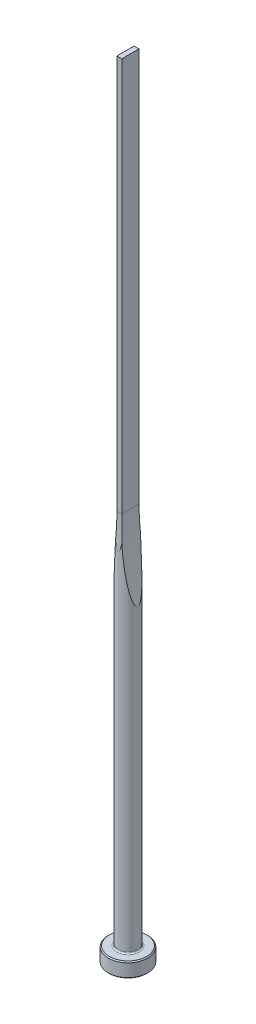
ISO-10303-21;
HEADER;
FILE_DESCRIPTION(('STEP AP214'),'2;1');
FILE_NAME('part.step','',(''),(''),'','','');
FILE_SCHEMA(('AUTOMOTIVE_DESIGN { 1 0 10303 214 1 1 1 1 }'));
ENDSEC;
DATA;
#1=APPLICATION_CONTEXT('core data for automotive mechanical design processes');
#2=APPLICATION_PROTOCOL_DEFINITION('international standard','automotive_design',2000,#1);
#3=PRODUCT_CONTEXT('',#1,'mechanical');
#4=PRODUCT('Part','Part','',(#3));
#5=PRODUCT_RELATED_PRODUCT_CATEGORY('part','',(#4));
#6=PRODUCT_DEFINITION_FORMATION('','',#4);
#7=PRODUCT_DEFINITION_CONTEXT('part definition',#1,'design');
#8=PRODUCT_DEFINITION('design','',#6,#7);
#9=PRODUCT_DEFINITION_SHAPE('','',#8);
#10=(LENGTH_UNIT() NAMED_UNIT(*) SI_UNIT(.MILLI.,.METRE.));
#11=(NAMED_UNIT(*) PLANE_ANGLE_UNIT() SI_UNIT($,.RADIAN.));
#12=(NAMED_UNIT(*) SI_UNIT($,.STERADIAN.) SOLID_ANGLE_UNIT());
#13=UNCERTAINTY_MEASURE_WITH_UNIT(LENGTH_MEASURE(1.E-05),#10,'distance_accuracy_value','');
#14=(GEOMETRIC_REPRESENTATION_CONTEXT(3) GLOBAL_UNCERTAINTY_ASSIGNED_CONTEXT((#13)) GLOBAL_UNIT_ASSIGNED_CONTEXT((#10,
#11,#12)) REPRESENTATION_CONTEXT('',''));
#15=CARTESIAN_POINT('',(0.,0.,0.));
#16=DIRECTION('',(0.,0.,1.));
#17=DIRECTION('',(1.,0.,0.));
#18=AXIS2_PLACEMENT_3D('',#15,#16,#17);
#19=CARTESIAN_POINT('',(0.,0.,0.));
#20=DIRECTION('',(0.,1.,0.));
#21=DIRECTION('',(-1.,0.,0.));
#22=AXIS2_PLACEMENT_3D('',#19,#20,#21);
#23=PLANE('',#22);
#24=CARTESIAN_POINT('',(0.,0.,0.));
#25=DIRECTION('',(0.,1.,0.));
#26=DIRECTION('',(-1.,0.,0.));
#27=AXIS2_PLACEMENT_3D('',#24,#25,#26);
#28=CIRCLE('',#27,3.8);
#29=CARTESIAN_POINT('',(-3.8,0.,0.));
#30=VERTEX_POINT('',#29);
#31=EDGE_CURVE('E133',#30,#30,#28,.T.);
#32=ORIENTED_EDGE('',*,*,#31,.F.);
#33=EDGE_LOOP('',(#32));
#34=FACE_BOUND('',#33,.T.);
#35=ADVANCED_FACE('F32',(#34),#23,.F.);
#36=CARTESIAN_POINT('',(0.,0.,0.));
#37=DIRECTION('',(0.,1.,0.));
#38=DIRECTION('',(-1.,0.,0.));
#39=AXIS2_PLACEMENT_3D('',#36,#37,#38);
#40=CONICAL_SURFACE('',#39,3.8,0.785398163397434);
#41=CARTESIAN_POINT('',(0.,0.200000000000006,0.));
#42=DIRECTION('',(0.,1.,0.));
#43=DIRECTION('',(-1.,0.,0.));
#44=AXIS2_PLACEMENT_3D('',#41,#42,#43);
#45=CIRCLE('',#44,4.);
#46=CARTESIAN_POINT('',(-4.,0.200000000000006,0.));
#47=VERTEX_POINT('',#46);
#48=EDGE_CURVE('E130',#47,#47,#45,.T.);
#49=ORIENTED_EDGE('',*,*,#48,.F.);
#50=EDGE_LOOP('',(#49));
#51=FACE_BOUND('',#50,.T.);
#52=ORIENTED_EDGE('',*,*,#31,.T.);
#53=EDGE_LOOP('',(#52));
#54=FACE_BOUND('',#53,.T.);
#55=ADVANCED_FACE('F171',(#51,#54),#40,.T.);
#56=CARTESIAN_POINT('',(0.,160.,0.));
#57=DIRECTION('',(0.,1.,0.));
#58=DIRECTION('',(-1.,0.,0.));
#59=AXIS2_PLACEMENT_3D('',#56,#57,#58);
#60=CYLINDRICAL_SURFACE('',#59,4.);
#61=CARTESIAN_POINT('',(0.,2.8,0.));
#62=DIRECTION('',(0.,1.,0.));
#63=DIRECTION('',(-1.,0.,0.));
#64=AXIS2_PLACEMENT_3D('',#61,#62,#63);
#65=CIRCLE('',#64,4.);
#66=CARTESIAN_POINT('',(-4.,2.8,0.));
#67=VERTEX_POINT('',#66);
#68=EDGE_CURVE('E127',#67,#67,#65,.T.);
#69=ORIENTED_EDGE('',*,*,#68,.F.);
#70=EDGE_LOOP('',(#69));
#71=FACE_BOUND('',#70,.T.);
#72=ORIENTED_EDGE('',*,*,#48,.T.);
#73=EDGE_LOOP('',(#72));
#74=FACE_BOUND('',#73,.T.);
#75=ADVANCED_FACE('F176',(#71,#74),#60,.T.);
#76=CARTESIAN_POINT('',(0.,2.8,0.));
#77=DIRECTION('',(0.,-1.,0.));
#78=DIRECTION('',(1.,0.,0.));
#79=AXIS2_PLACEMENT_3D('',#76,#77,#78);
#80=CONICAL_SURFACE('',#79,4.,0.785398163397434);
#81=CARTESIAN_POINT('',(0.,3.,0.));
#82=DIRECTION('',(0.,1.,0.));
#83=DIRECTION('',(-1.,0.,0.));
#84=AXIS2_PLACEMENT_3D('',#81,#82,#83);
#85=CIRCLE('',#84,3.8);
#86=CARTESIAN_POINT('',(-3.8,3.,0.));
#87=VERTEX_POINT('',#86);
#88=EDGE_CURVE('E124',#87,#87,#85,.T.);
#89=ORIENTED_EDGE('',*,*,#88,.F.);
#90=EDGE_LOOP('',(#89));
#91=FACE_BOUND('',#90,.T.);
#92=ORIENTED_EDGE('',*,*,#68,.T.);
#93=EDGE_LOOP('',(#92));
#94=FACE_BOUND('',#93,.T.);
#95=ADVANCED_FACE('F183',(#91,#94),#80,.T.);
#96=CARTESIAN_POINT('',(3.8,3.,0.));
#97=DIRECTION('',(0.,-1.,0.));
#98=DIRECTION('',(1.,0.,0.));
#99=AXIS2_PLACEMENT_3D('',#96,#97,#98);
#100=PLANE('',#99);
#101=CARTESIAN_POINT('',(0.,3.,0.));
#102=DIRECTION('',(0.,1.,0.));
#103=DIRECTION('',(-1.,0.,0.));
#104=AXIS2_PLACEMENT_3D('',#101,#102,#103);
#105=CIRCLE('',#104,2.30000000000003);
#106=CARTESIAN_POINT('',(-2.30000000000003,3.,0.));
#107=VERTEX_POINT('',#106);
#108=EDGE_CURVE('E121',#107,#107,#105,.T.);
#109=ORIENTED_EDGE('',*,*,#108,.F.);
#110=EDGE_LOOP('',(#109));
#111=FACE_BOUND('',#110,.T.);
#112=ORIENTED_EDGE('',*,*,#88,.T.);
#113=EDGE_LOOP('',(#112));
#114=FACE_BOUND('',#113,.T.);
#115=ADVANCED_FACE('F190',(#111,#114),#100,.F.);
#116=CARTESIAN_POINT('',(0.,3.3,0.));
#117=DIRECTION('',(0.,1.,0.));
#118=DIRECTION('',(-1.,0.,0.));
#119=AXIS2_PLACEMENT_3D('',#116,#117,#118);
#120=TOROIDAL_SURFACE('',#119,2.30000000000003,0.3);
#121=CARTESIAN_POINT('',(0.,3.3,0.));
#122=DIRECTION('',(0.,1.,0.));
#123=DIRECTION('',(-1.,0.,0.));
#124=AXIS2_PLACEMENT_3D('',#121,#122,#123);
#125=CIRCLE('',#124,2.00000000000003);
#126=CARTESIAN_POINT('',(-2.00000000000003,3.3,0.));
#127=VERTEX_POINT('',#126);
#128=EDGE_CURVE('E112',#127,#127,#125,.T.);
#129=ORIENTED_EDGE('',*,*,#128,.F.);
#130=EDGE_LOOP('',(#129));
#131=FACE_BOUND('',#130,.T.);
#132=ORIENTED_EDGE('',*,*,#108,.T.);
#133=EDGE_LOOP('',(#132));
#134=FACE_BOUND('',#133,.T.);
#135=ADVANCED_FACE('F168',(#131,#134),#120,.F.);
#136=CARTESIAN_POINT('',(0.,160.,0.));
#137=DIRECTION('',(0.,1.,0.));
#138=DIRECTION('',(-1.,0.,0.));
#139=AXIS2_PLACEMENT_3D('',#136,#137,#138);
#140=CYLINDRICAL_SURFACE('',#139,2.00000000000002);
#141=CARTESIAN_POINT('',(2.00000000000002,63.6369318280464,0.));
#142=CARTESIAN_POINT('',(1.99999959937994,63.6369339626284,0.0223459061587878));
#143=CARTESIAN_POINT('',(1.99962083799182,63.6389821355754,0.0447004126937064));
#144=CARTESIAN_POINT('',(1.99815425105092,63.6469172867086,0.0886950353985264));
#145=CARTESIAN_POINT('',(1.9970654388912,63.6528096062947,0.110334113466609));
#146=CARTESIAN_POINT('',(1.9938912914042,63.6700025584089,0.158557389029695));
#147=CARTESIAN_POINT('',(1.99160771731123,63.6823805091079,0.184738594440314));
#148=CARTESIAN_POINT('',(1.98633144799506,63.7110254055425,0.234784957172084));
#149=CARTESIAN_POINT('',(1.98333711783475,63.7273013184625,0.258644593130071));
#150=CARTESIAN_POINT('',(1.9743629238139,63.7761726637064,0.321817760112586));
#151=CARTESIAN_POINT('',(1.96786628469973,63.8116478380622,0.358796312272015));
#152=CARTESIAN_POINT('',(1.95408957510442,63.8871713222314,0.427500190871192));
#153=CARTESIAN_POINT('',(1.94680713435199,63.9272334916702,0.45920884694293));
#154=CARTESIAN_POINT('',(1.92754936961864,64.0336190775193,0.535616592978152));
#155=CARTESIAN_POINT('',(1.91526044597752,64.1019205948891,0.577448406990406));
#156=CARTESIAN_POINT('',(1.89023046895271,64.2420223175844,0.654719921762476));
#157=CARTESIAN_POINT('',(1.87748839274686,64.3138305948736,0.69014389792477));
#158=CARTESIAN_POINT('',(1.8517537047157,64.4599241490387,0.756491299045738));
#159=CARTESIAN_POINT('',(1.83876009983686,64.5342208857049,0.787388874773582));
#160=CARTESIAN_POINT('',(1.81274809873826,64.6840888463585,0.845549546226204));
#161=CARTESIAN_POINT('',(1.79972975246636,64.7596583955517,0.87281705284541));
#162=CARTESIAN_POINT('',(1.77256783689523,64.9185595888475,0.926820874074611));
#163=CARTESIAN_POINT('',(1.75842768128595,65.0019813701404,0.95329194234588));
#164=CARTESIAN_POINT('',(1.73025157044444,65.1696595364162,1.00352104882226));
#165=CARTESIAN_POINT('',(1.71621563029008,65.253916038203,1.02727870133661));
#166=CARTESIAN_POINT('',(1.67431249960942,65.5077044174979,1.09523119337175));
#167=CARTESIAN_POINT('',(1.64666477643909,65.6781687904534,1.13607747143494));
#168=CARTESIAN_POINT('',(1.59207672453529,66.0210365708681,1.21137932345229));
#169=CARTESIAN_POINT('',(1.56513835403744,66.1934437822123,1.24581853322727));
#170=CARTESIAN_POINT('',(1.51214029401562,66.5392639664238,1.30963761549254));
#171=CARTESIAN_POINT('',(1.48608034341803,66.7126766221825,1.33901900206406));
#172=CARTESIAN_POINT('',(1.43486714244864,67.0604086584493,1.39375720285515));
#173=CARTESIAN_POINT('',(1.40971464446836,67.2347286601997,1.419110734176));
#174=CARTESIAN_POINT('',(1.36037231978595,67.5839667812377,1.46647728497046));
#175=CARTESIAN_POINT('',(1.33618256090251,67.7588849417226,1.48849006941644));
#176=CARTESIAN_POINT('',(1.28882757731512,68.1089168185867,1.52967523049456));
#177=CARTESIAN_POINT('',(1.26566085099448,68.2840298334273,1.54885187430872));
#178=CARTESIAN_POINT('',(1.22032996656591,68.6346243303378,1.5848120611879));
#179=CARTESIAN_POINT('',(1.19816578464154,68.8101058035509,1.60159566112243));
#180=CARTESIAN_POINT('',(1.13349124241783,69.3346050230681,1.64864861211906));
#181=CARTESIAN_POINT('',(1.092473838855,69.6840801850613,1.67589262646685));
#182=CARTESIAN_POINT('',(1.01449864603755,70.3839177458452,1.72420545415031));
#183=CARTESIAN_POINT('',(0.977541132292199,70.7342802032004,1.74527384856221));
#184=CARTESIAN_POINT('',(0.907713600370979,71.4357442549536,1.78258876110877));
#185=CARTESIAN_POINT('',(0.874844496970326,71.7868459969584,1.79883420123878));
#186=CARTESIAN_POINT('',(0.813223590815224,72.489570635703,1.82751742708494));
#187=CARTESIAN_POINT('',(0.784471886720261,72.8411935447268,1.83995512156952));
#188=CARTESIAN_POINT('',(0.731059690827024,73.5453720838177,1.86182337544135));
#189=CARTESIAN_POINT('',(0.706405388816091,73.8979283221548,1.87124940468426));
#190=CARTESIAN_POINT('',(0.661248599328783,74.6033645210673,1.8876763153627));
#191=CARTESIAN_POINT('',(0.640746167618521,74.956244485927,1.89467716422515));
#192=CARTESIAN_POINT('',(0.585481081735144,76.0151631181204,1.91278651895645));
#193=CARTESIAN_POINT('',(0.556952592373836,76.7215865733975,1.9210048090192));
#194=CARTESIAN_POINT('',(0.516517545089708,78.1360547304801,1.93226157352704));
#195=CARTESIAN_POINT('',(0.504637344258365,78.8441002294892,1.93529183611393));
#196=CARTESIAN_POINT('',(0.497590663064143,80.2603118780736,1.93711555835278));
#197=CARTESIAN_POINT('',(0.502424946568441,80.9684780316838,1.93590882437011));
#198=CARTESIAN_POINT('',(0.528792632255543,82.3837383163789,1.92887969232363));
#199=CARTESIAN_POINT('',(0.550308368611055,83.0908327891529,1.92306217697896));
#200=CARTESIAN_POINT('',(0.595075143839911,84.1508511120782,1.90947934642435));
#201=CARTESIAN_POINT('',(0.612079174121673,84.5040802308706,1.9041424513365));
#202=CARTESIAN_POINT('',(0.650247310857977,85.2102761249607,1.89145128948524));
#203=CARTESIAN_POINT('',(0.671411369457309,85.5632429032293,1.88409704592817));
#204=CARTESIAN_POINT('',(0.717844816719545,86.2681013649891,1.86689845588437));
#205=CARTESIAN_POINT('',(0.743105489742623,86.6199937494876,1.85705937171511));
#206=CARTESIAN_POINT('',(0.79775484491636,87.3233627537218,1.83424790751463));
#207=CARTESIAN_POINT('',(0.827143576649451,87.6748393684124,1.82127548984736));
#208=CARTESIAN_POINT('',(0.890074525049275,88.3777029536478,1.79136371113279));
#209=CARTESIAN_POINT('',(0.923621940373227,88.7290892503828,1.7744193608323));
#210=CARTESIAN_POINT('',(0.994816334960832,89.4311489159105,1.73550864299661));
#211=CARTESIAN_POINT('',(1.03246301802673,89.7818223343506,1.71354263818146));
#212=CARTESIAN_POINT('',(1.11158826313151,90.4802015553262,1.66329673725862));
#213=CARTESIAN_POINT('',(1.15304311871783,90.8279127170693,1.63505453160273));
#214=CARTESIAN_POINT('',(1.23992287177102,91.5221969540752,1.57020891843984));
#215=CARTESIAN_POINT('',(1.28534897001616,91.8687696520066,1.53360297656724));
#216=CARTESIAN_POINT('',(1.35631554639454,92.3868414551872,1.47016943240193));
#217=CARTESIAN_POINT('',(1.38041701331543,92.5590642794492,1.44763070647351));
#218=CARTESIAN_POINT('',(1.42954752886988,92.9028929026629,1.39913926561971));
#219=CARTESIAN_POINT('',(1.454576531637,93.0744987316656,1.37318671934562));
#220=CARTESIAN_POINT('',(1.50551075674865,93.4168108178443,1.31714471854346));
#221=CARTESIAN_POINT('',(1.53141549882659,93.5875175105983,1.28705750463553));
#222=CARTESIAN_POINT('',(1.58405064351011,93.927798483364,1.2217012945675));
#223=CARTESIAN_POINT('',(1.61078090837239,94.0973729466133,1.18643315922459));
#224=CARTESIAN_POINT('',(1.6539704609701,94.3663968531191,1.12479455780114));
#225=CARTESIAN_POINT('',(1.67019715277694,94.4663857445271,1.10061905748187));
#226=CARTESIAN_POINT('',(1.70287155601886,94.6656117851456,1.04935942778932));
#227=CARTESIAN_POINT('',(1.71931932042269,94.7648487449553,1.02227459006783));
#228=CARTESIAN_POINT('',(1.75239134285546,94.9623523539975,0.964487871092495));
#229=CARTESIAN_POINT('',(1.76901575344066,95.0606179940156,0.933782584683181));
#230=CARTESIAN_POINT('',(1.80232271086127,95.2555503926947,0.86775608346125));
#231=CARTESIAN_POINT('',(1.81900523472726,95.3522177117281,0.832436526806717));
#232=CARTESIAN_POINT('',(1.85233564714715,95.5435207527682,0.7554099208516));
#233=CARTESIAN_POINT('',(1.86898314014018,95.6381469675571,0.713678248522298));
#234=CARTESIAN_POINT('',(1.89355523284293,95.7765692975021,0.644235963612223));
#235=CARTESIAN_POINT('',(1.90166612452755,95.8220505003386,0.619994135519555));
#236=CARTESIAN_POINT('',(1.91766149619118,95.9113598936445,0.568591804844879));
#237=CARTESIAN_POINT('',(1.92554594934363,95.9551878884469,0.541430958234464));
#238=CARTESIAN_POINT('',(1.94445150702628,96.0598482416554,0.470167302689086));
#239=CARTESIAN_POINT('',(1.95527858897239,96.1194068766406,0.423957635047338));
#240=CARTESIAN_POINT('',(1.97014146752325,96.200769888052,0.345325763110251));
#241=CARTESIAN_POINT('',(1.97489054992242,96.2266935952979,0.317364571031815));
#242=CARTESIAN_POINT('',(1.9835631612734,96.2739354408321,0.257652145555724));
#243=CARTESIAN_POINT('',(1.98748960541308,96.2952698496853,0.225914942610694));
#244=CARTESIAN_POINT('',(1.99266849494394,96.3233693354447,0.172252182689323));
#245=CARTESIAN_POINT('',(1.99435746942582,96.3325227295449,0.151632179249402));
#246=CARTESIAN_POINT('',(1.99713028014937,96.3475413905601,0.109184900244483));
#247=CARTESIAN_POINT('',(1.99821491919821,96.3534110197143,0.0873592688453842));
#248=CARTESIAN_POINT('',(1.99966711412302,96.3612681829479,0.0427916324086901));
#249=CARTESIAN_POINT('',(2.00002878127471,96.363223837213,0.0200436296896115));
#250=CARTESIAN_POINT('',(1.99996760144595,96.3628929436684,-0.0254230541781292));
#251=CARTESIAN_POINT('',(1.99954467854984,96.3606059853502,-0.0481417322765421));
#252=CARTESIAN_POINT('',(1.99804295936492,96.3524803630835,-0.0907709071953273));
#253=CARTESIAN_POINT('',(1.9970263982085,96.3469786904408,-0.110750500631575));
#254=CARTESIAN_POINT('',(1.99448592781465,96.3332185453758,-0.149690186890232));
#255=CARTESIAN_POINT('',(1.99296174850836,96.3249586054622,-0.168649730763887));
#256=CARTESIAN_POINT('',(1.98831296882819,96.2997396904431,-0.218154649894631));
#257=CARTESIAN_POINT('',(1.98481178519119,96.2807219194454,-0.247608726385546));
#258=CARTESIAN_POINT('',(1.9770691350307,96.2385707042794,-0.303299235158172));
#259=CARTESIAN_POINT('',(1.97282513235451,96.2154231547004,-0.329524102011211));
#260=CARTESIAN_POINT('',(1.95935725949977,96.1417794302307,-0.404383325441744));
#261=CARTESIAN_POINT('',(1.94943417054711,96.0872801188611,-0.448889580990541));
#262=CARTESIAN_POINT('',(1.92879683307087,95.9732711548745,-0.53056135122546));
#263=CARTESIAN_POINT('',(1.91808016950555,95.9137461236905,-0.567703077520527));
#264=CARTESIAN_POINT('',(1.89724400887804,95.7973037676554,-0.633676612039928));
#265=CARTESIAN_POINT('',(1.88715715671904,95.74063137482,-0.66295495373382));
#266=CARTESIAN_POINT('',(1.86682157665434,95.6257191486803,-0.718219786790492));
#267=CARTESIAN_POINT('',(1.85657275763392,95.5674784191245,-0.744204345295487));
#268=CARTESIAN_POINT('',(1.82568757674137,95.3909251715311,-0.818391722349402));
#269=CARTESIAN_POINT('',(1.80495249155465,95.271004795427,-0.862710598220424));
#270=CARTESIAN_POINT('',(1.76350002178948,95.0282684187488,-0.944537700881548));
#271=CARTESIAN_POINT('',(1.74278323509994,94.9054410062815,-0.982011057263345));
#272=CARTESIAN_POINT('',(1.7016565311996,94.6584394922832,-1.05166411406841));
#273=CARTESIAN_POINT('',(1.68124623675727,94.5342674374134,-1.08385090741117));
#274=CARTESIAN_POINT('',(1.64101494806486,94.2862310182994,-1.14383417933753));
#275=CARTESIAN_POINT('',(1.62118998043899,94.1623776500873,-1.17167406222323));
#276=CARTESIAN_POINT('',(1.58195540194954,93.9139199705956,-1.22412636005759));
#277=CARTESIAN_POINT('',(1.56254582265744,93.7893156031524,-1.24873853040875));
#278=CARTESIAN_POINT('',(1.50498233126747,93.4145704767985,-1.31859618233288));
#279=CARTESIAN_POINT('',(1.46750707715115,93.1635803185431,-1.35984370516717));
#280=CARTESIAN_POINT('',(1.39446681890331,92.6597358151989,-1.43463394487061));
#281=CARTESIAN_POINT('',(1.35890544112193,92.4068788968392,-1.4681624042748));
#282=CARTESIAN_POINT('',(1.28985321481,91.9002128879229,-1.52918268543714));
#283=CARTESIAN_POINT('',(1.25636197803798,91.6464039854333,-1.55667564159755));
#284=CARTESIAN_POINT('',(1.19153191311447,91.1383585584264,-1.60683751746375));
#285=CARTESIAN_POINT('',(1.16019052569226,90.8841229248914,-1.62951224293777));
#286=CARTESIAN_POINT('',(1.09964458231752,90.3750740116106,-1.67096428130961));
#287=CARTESIAN_POINT('',(1.07044011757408,90.1202607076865,-1.68974142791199));
#288=CARTESIAN_POINT('',(0.98611967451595,89.3556408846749,-1.74124672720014));
#289=CARTESIAN_POINT('',(0.934232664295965,88.8451532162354,-1.76919522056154));
#290=CARTESIAN_POINT('',(0.839538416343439,87.8269457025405,-1.81601562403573));
#291=CARTESIAN_POINT('',(0.796663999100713,87.3192350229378,-1.83495612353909));
#292=CARTESIAN_POINT('',(0.71953113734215,86.3029451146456,-1.86655063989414));
#293=CARTESIAN_POINT('',(0.685273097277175,85.7943658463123,-1.87920436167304));
#294=CARTESIAN_POINT('',(0.625385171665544,84.7763705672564,-1.89997212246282));
#295=CARTESIAN_POINT('',(0.599759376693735,84.2669542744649,-1.90808401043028));
#296=CARTESIAN_POINT('',(0.557171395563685,83.2477280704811,-1.92095127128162));
#297=CARTESIAN_POINT('',(0.54020905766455,82.7379181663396,-1.92570670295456));
#298=CARTESIAN_POINT('',(0.514960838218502,81.7183267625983,-1.93261112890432));
#299=CARTESIAN_POINT('',(0.506670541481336,81.2085453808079,-1.93476144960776));
#300=CARTESIAN_POINT('',(0.498754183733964,80.1889064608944,-1.93681718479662));
#301=CARTESIAN_POINT('',(0.499128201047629,79.6790489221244,-1.9367225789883));
#302=CARTESIAN_POINT('',(0.508539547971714,78.6595267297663,-1.93427286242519));
#303=CARTESIAN_POINT('',(0.5175750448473,78.149862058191,-1.93191822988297));
#304=CARTESIAN_POINT('',(0.544302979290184,77.1307884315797,-1.92455879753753));
#305=CARTESIAN_POINT('',(0.561995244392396,76.6213794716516,-1.91955405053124));
#306=CARTESIAN_POINT('',(0.606629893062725,75.5890885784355,-1.90592838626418));
#307=CARTESIAN_POINT('',(0.633811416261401,75.0662181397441,-1.89721255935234));
#308=CARTESIAN_POINT('',(0.697287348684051,74.0211319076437,-1.87481290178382));
#309=CARTESIAN_POINT('',(0.733581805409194,73.4989161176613,-1.86112904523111));
#310=CARTESIAN_POINT('',(0.815237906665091,72.4556613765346,-1.82684566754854));
#311=CARTESIAN_POINT('',(0.860595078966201,71.9346219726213,-1.80624955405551));
#312=CARTESIAN_POINT('',(0.93539833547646,71.1540708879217,-1.76799386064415));
#313=CARTESIAN_POINT('',(0.961461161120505,70.8940508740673,-1.75401474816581));
#314=CARTESIAN_POINT('',(1.01583096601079,70.3744231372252,-1.72309839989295));
#315=CARTESIAN_POINT('',(1.04413791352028,70.11481540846,-1.70616120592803));
#316=CARTESIAN_POINT('',(1.11329294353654,69.5051986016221,-1.66216858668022));
#317=CARTESIAN_POINT('',(1.15505916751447,69.1553968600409,-1.6336474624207));
#318=CARTESIAN_POINT('',(1.242588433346,68.4571129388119,-1.56811548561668));
#319=CARTESIAN_POINT('',(1.28835090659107,68.1086305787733,-1.53110583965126));
#320=CARTESIAN_POINT('',(1.3685170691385,67.5245931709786,-1.45912605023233));
#321=CARTESIAN_POINT('',(1.40188146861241,67.2885124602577,-1.42727858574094));
#322=CARTESIAN_POINT('',(1.47033119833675,66.8176392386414,-1.356674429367));
#323=CARTESIAN_POINT('',(1.50541631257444,66.5828465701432,-1.31791860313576));
#324=CARTESIAN_POINT('',(1.56586956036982,66.18889183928,-1.24480040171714));
#325=CARTESIAN_POINT('',(1.59081615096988,66.0292096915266,-1.21290136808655));
#326=CARTESIAN_POINT('',(1.64138444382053,65.7111106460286,-1.14355345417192));
#327=CARTESIAN_POINT('',(1.66700624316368,65.5526939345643,-1.10610377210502));
#328=CARTESIAN_POINT('',(1.71077059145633,65.2865745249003,-1.0365247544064));
#329=CARTESIAN_POINT('',(1.72877472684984,65.178344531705,-1.00633379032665));
#330=CARTESIAN_POINT('',(1.76494280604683,64.9633285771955,-0.941469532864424));
#331=CARTESIAN_POINT('',(1.7831066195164,64.8565415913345,-0.906799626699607));
#332=CARTESIAN_POINT('',(1.81396089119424,64.6770737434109,-0.842848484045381));
#333=CARTESIAN_POINT('',(1.82664500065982,64.6038471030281,-0.815109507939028));
#334=CARTESIAN_POINT('',(1.85195768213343,64.458763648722,-0.755839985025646));
#335=CARTESIAN_POINT('',(1.86458610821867,64.3869096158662,-0.724302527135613));
#336=CARTESIAN_POINT('',(1.89040343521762,64.2410282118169,-0.654124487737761));
#337=CARTESIAN_POINT('',(1.90357788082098,64.1671467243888,-0.615162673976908));
#338=CARTESIAN_POINT('',(1.92281794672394,64.0599829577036,-0.550693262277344));
#339=CARTESIAN_POINT('',(1.92913565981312,64.0249192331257,-0.528235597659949));
#340=CARTESIAN_POINT('',(1.94150282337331,63.9565035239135,-0.480802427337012));
#341=CARTESIAN_POINT('',(1.94755251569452,63.9231499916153,-0.455829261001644));
#342=CARTESIAN_POINT('',(1.95806876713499,63.865344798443,-0.407971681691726));
#343=CARTESIAN_POINT('',(1.96261120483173,63.8404403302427,-0.385656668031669));
#344=CARTESIAN_POINT('',(1.97129564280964,63.7929309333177,-0.338482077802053));
#345=CARTESIAN_POINT('',(1.97543676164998,63.7703310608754,-0.313617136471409));
#346=CARTESIAN_POINT('',(1.98314721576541,63.7283303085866,-0.26050232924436));
#347=CARTESIAN_POINT('',(1.98670628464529,63.7089867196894,-0.232204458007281));
#348=CARTESIAN_POINT('',(1.99278059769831,63.676017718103,-0.172374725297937));
#349=CARTESIAN_POINT('',(1.99530171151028,63.6623601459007,-0.140862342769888));
#350=CARTESIAN_POINT('',(1.99802431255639,63.6476201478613,-0.0906024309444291));
#351=CARTESIAN_POINT('',(1.99875930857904,63.6436433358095,-0.0727259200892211));
#352=CARTESIAN_POINT('',(1.99974726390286,63.6382985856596,-0.0365681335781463));
#353=CARTESIAN_POINT('',(2.00000032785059,63.6369300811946,-0.0182869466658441));
#354=CARTESIAN_POINT('',(2.00000000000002,63.6369318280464,0.));
#355=B_SPLINE_CURVE_WITH_KNOTS('',3,(#141,#142,#143,#144,#145,#146,#147,#148,#149,#150,#151,
#152,#153,#154,#155,#156,#157,#158,#159,#160,#161,#162,#163,#164,#165,#166,#167,#168,#169,#170,
#171,#172,#173,#174,#175,#176,#177,#178,#179,#180,#181,#182,#183,#184,#185,#186,#187,#188,#189,
#190,#191,#192,#193,#194,#195,#196,#197,#198,#199,#200,#201,#202,#203,#204,#205,#206,#207,#208,
#209,#210,#211,#212,#213,#214,#215,#216,#217,#218,#219,#220,#221,#222,#223,#224,#225,#226,#227,
#228,#229,#230,#231,#232,#233,#234,#235,#236,#237,#238,#239,#240,#241,#242,#243,#244,#245,#246,
#247,#248,#249,#250,#251,#252,#253,#254,#255,#256,#257,#258,#259,#260,#261,#262,#263,#264,#265,
#266,#267,#268,#269,#270,#271,#272,#273,#274,#275,#276,#277,#278,#279,#280,#281,#282,#283,#284,
#285,#286,#287,#288,#289,#290,#291,#292,#293,#294,#295,#296,#297,#298,#299,#300,#301,#302,#303,
#304,#305,#306,#307,#308,#309,#310,#311,#312,#313,#314,#315,#316,#317,#318,#319,#320,#321,#322,
#323,#324,#325,#326,#327,#328,#329,#330,#331,#332,#333,#334,#335,#336,#337,#338,#339,#340,#341,
#342,#343,#344,#345,#346,#347,#348,#349,#350,#351,#352,#353,#354),.UNSPECIFIED.,.T.,.F.,(4,2,2,
2,2,2,2,2,2,2,2,2,2,2,2,2,2,2,2,2,2,2,2,2,2,2,2,2,2,2,2,2,2,2,2,2,2,2,2,2,2,2,2,2,2,2,2,2,2,2,2,
2,2,2,2,2,2,2,2,2,2,2,2,2,2,2,2,2,2,2,2,2,2,2,2,2,2,2,2,2,2,2,2,2,2,2,2,2,2,2,2,2,2,2,2,2,2,2,2,
2,2,2,2,2,2,2,4),(0.,0.0669624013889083,0.134018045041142,0.220670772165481,0.307524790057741,
0.461614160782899,0.616182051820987,0.858650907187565,1.10170693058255,1.34610098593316,
1.59019531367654,1.85610381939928,2.12205007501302,2.65421827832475,3.18772756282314,
3.72107686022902,4.25485865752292,4.78867798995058,5.32168579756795,5.85468093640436,
6.91335433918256,7.97209954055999,9.03108120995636,10.090088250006,11.1506808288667,
12.2112876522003,14.3321822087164,16.4564307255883,18.5807763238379,20.7028752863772,
21.763886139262,22.8248847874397,23.8836550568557,24.942438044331,26.0025581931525,
27.062601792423,28.1164437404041,29.1706054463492,29.6966440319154,30.2226566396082,
30.7483853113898,31.2740267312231,31.5864186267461,31.8988867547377,32.2116511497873,
32.5243034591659,32.8381878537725,32.9946058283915,33.1510422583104,33.3782257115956,
33.4932147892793,33.6077892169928,33.6754354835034,33.742991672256,33.8110959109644,
33.8792067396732,33.9412079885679,34.003242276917,34.1083294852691,34.2137827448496,
34.4257772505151,34.6384457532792,34.8320405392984,35.0257484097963,35.4139275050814,
35.8040319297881,36.1936086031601,36.5790049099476,36.9644304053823,37.7355387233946,
38.5080600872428,39.2804361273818,40.0518761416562,40.8233490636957,42.3647732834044,
43.8942649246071,45.4238283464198,46.9541155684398,48.4843759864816,50.0138569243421,
51.543351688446,53.0725228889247,54.6016636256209,56.1725124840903,57.7433695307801,
59.3134533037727,60.0985213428,60.883578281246,61.9437988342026,63.0038687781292,
63.7254256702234,64.4468922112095,64.9410344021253,65.4352480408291,65.7765660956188,
66.117627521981,66.3555218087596,66.5938556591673,66.8471216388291,66.9733921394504,
67.099546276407,67.2006585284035,67.301988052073,67.4049471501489,67.5073157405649,
67.5621268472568,67.6169260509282),.UNSPECIFIED.);
#356=CARTESIAN_POINT('',(0.643611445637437,74.917733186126,-1.89361144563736));
#357=VERTEX_POINT('',#356);
#358=CARTESIAN_POINT('',(0.643611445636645,74.9177331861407,1.89361144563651));
#359=VERTEX_POINT('',#358);
#360=EDGE_CURVE('E138',#357,#359,#355,.T.);
#361=ORIENTED_EDGE('',*,*,#360,.T.);
#362=CARTESIAN_POINT('',(-0.968245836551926,80.,1.74999999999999));
#363=CARTESIAN_POINT('',(-0.968238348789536,80.3335504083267,1.74999985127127));
#364=CARTESIAN_POINT('',(-0.964913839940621,80.6670930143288,1.75185441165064));
#365=CARTESIAN_POINT('',(-0.95133548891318,81.3339943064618,1.75926912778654));
#366=CARTESIAN_POINT('',(-0.941081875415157,81.6673529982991,1.76482916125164));
#367=CARTESIAN_POINT('',(-0.912720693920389,82.3344915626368,1.77966177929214));
#368=CARTESIAN_POINT('',(-0.894593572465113,82.6682704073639,1.78894360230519));
#369=CARTESIAN_POINT('',(-0.848686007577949,83.3349608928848,1.81119198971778));
#370=CARTESIAN_POINT('',(-0.820909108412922,83.6678728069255,1.82415720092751));
#371=CARTESIAN_POINT('',(-0.769005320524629,84.1665035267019,1.84634021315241));
#372=CARTESIAN_POINT('',(-0.749965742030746,84.3328098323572,1.85420260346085));
#373=CARTESIAN_POINT('',(-0.707487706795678,84.6649255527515,1.87082483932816));
#374=CARTESIAN_POINT('',(-0.68404656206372,84.8307346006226,1.87958523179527));
#375=CARTESIAN_POINT('',(-0.631397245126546,85.160652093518,1.89792815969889));
#376=CARTESIAN_POINT('',(-0.602215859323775,85.324764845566,1.90750676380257));
#377=CARTESIAN_POINT('',(-0.551786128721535,85.5694473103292,1.92245449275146));
#378=CARTESIAN_POINT('',(-0.533878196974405,85.6507164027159,1.92753077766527));
#379=CARTESIAN_POINT('',(-0.495093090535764,85.8125239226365,1.9378564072));
#380=CARTESIAN_POINT('',(-0.474216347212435,85.8930624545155,1.94310572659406));
#381=CARTESIAN_POINT('',(-0.428292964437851,86.053075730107,1.95374902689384));
#382=CARTESIAN_POINT('',(-0.403242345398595,86.1325493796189,1.95914314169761));
#383=CARTESIAN_POINT('',(-0.360560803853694,86.2502226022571,1.96728291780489));
#384=CARTESIAN_POINT('',(-0.345421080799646,86.2893239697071,1.97001385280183));
#385=CARTESIAN_POINT('',(-0.31280955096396,86.3665326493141,1.97545600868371));
#386=CARTESIAN_POINT('',(-0.295340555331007,86.4046410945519,1.97816724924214));
#387=CARTESIAN_POINT('',(-0.256751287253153,86.4796372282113,1.98354888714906));
#388=CARTESIAN_POINT('',(-0.235581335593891,86.5164989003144,1.98621810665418));
#389=CARTESIAN_POINT('',(-0.187728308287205,86.586387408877,1.99131986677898));
#390=CARTESIAN_POINT('',(-0.161126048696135,86.6194604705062,1.99375518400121));
#391=CARTESIAN_POINT('',(-0.12075108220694,86.6547640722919,1.99636953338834));
#392=CARTESIAN_POINT('',(-0.111560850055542,86.6620369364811,1.99690919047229));
#393=CARTESIAN_POINT('',(-0.0922735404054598,86.6752894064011,1.9978938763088));
#394=CARTESIAN_POINT('',(-0.082177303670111,86.6812701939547,1.99833899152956));
#395=CARTESIAN_POINT('',(-0.0632207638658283,86.6903867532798,1.99901815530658));
#396=CARTESIAN_POINT('',(-0.0545231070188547,86.6938532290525,1.99927668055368));
#397=CARTESIAN_POINT('',(-0.0366717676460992,86.6993072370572,1.99968362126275));
#398=CARTESIAN_POINT('',(-0.0275187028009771,86.7012967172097,1.99983218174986));
#399=CARTESIAN_POINT('',(-0.00893111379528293,86.7035672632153,2.00000174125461));
#400=CARTESIAN_POINT('',(0.000504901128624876,86.7038366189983,2.00002186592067));
#401=CARTESIAN_POINT('',(0.0192584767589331,86.7025973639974,1.99992930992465));
#402=CARTESIAN_POINT('',(0.0285759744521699,86.7010878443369,1.99981656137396));
#403=CARTESIAN_POINT('',(0.047938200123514,86.6961998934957,1.99945173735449));
#404=CARTESIAN_POINT('',(0.0579283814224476,86.6926115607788,1.99918401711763));
#405=CARTESIAN_POINT('',(0.0771947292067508,86.6838760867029,1.99853304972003));
#406=CARTESIAN_POINT('',(0.0864694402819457,86.6787258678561,1.99814957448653));
#407=CARTESIAN_POINT('',(0.110056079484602,86.6635871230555,1.99702403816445));
#408=CARTESIAN_POINT('',(0.123732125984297,86.6526274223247,1.99621074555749));
#409=CARTESIAN_POINT('',(0.149379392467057,86.6288928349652,1.99445462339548));
#410=CARTESIAN_POINT('',(0.161345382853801,86.6161126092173,1.99351141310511));
#411=CARTESIAN_POINT('',(0.205772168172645,86.5638954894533,1.9896704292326));
#412=CARTESIAN_POINT('',(0.233384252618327,86.5204677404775,1.98650266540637));
#413=CARTESIAN_POINT('',(0.283063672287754,86.4305772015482,1.98001734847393));
#414=CARTESIAN_POINT('',(0.305089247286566,86.3840946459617,1.97669887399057));
#415=CARTESIAN_POINT('',(0.346614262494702,86.287125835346,1.96985455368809));
#416=CARTESIAN_POINT('',(0.36592372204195,86.2365569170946,1.96632687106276));
#417=CARTESIAN_POINT('',(0.401868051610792,86.1344657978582,1.95929356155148));
#418=CARTESIAN_POINT('',(0.418500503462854,86.0829427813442,1.95578795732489));
#419=CARTESIAN_POINT('',(0.465545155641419,85.9272647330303,1.94533228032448));
#420=CARTESIAN_POINT('',(0.493020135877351,85.8222195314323,1.93845882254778));
#421=CARTESIAN_POINT('',(0.543128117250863,85.6109304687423,1.92501070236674));
#422=CARTESIAN_POINT('',(0.565757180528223,85.5046857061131,1.91843628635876));
#423=CARTESIAN_POINT('',(0.607474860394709,85.291651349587,1.90563570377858));
#424=CARTESIAN_POINT('',(0.626568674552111,85.184862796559,1.89940903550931));
#425=CARTESIAN_POINT('',(0.679606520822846,84.8655887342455,1.88136685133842));
#426=CARTESIAN_POINT('',(0.709688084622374,84.6524380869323,1.8700772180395));
#427=CARTESIAN_POINT('',(0.762936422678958,84.2251827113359,1.84897871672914));
#428=CARTESIAN_POINT('',(0.78610125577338,84.0110777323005,1.83917026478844));
#429=CARTESIAN_POINT('',(0.827204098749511,83.5820289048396,1.82105456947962));
#430=CARTESIAN_POINT('',(0.845135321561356,83.3670843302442,1.81274928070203));
#431=CARTESIAN_POINT('',(0.876742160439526,82.9368251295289,1.79767146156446));
#432=CARTESIAN_POINT('',(0.890417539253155,82.7215104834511,1.79089901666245));
#433=CARTESIAN_POINT('',(0.926042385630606,82.0754331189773,1.77290217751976));
#434=CARTESIAN_POINT('',(0.94261125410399,81.6443036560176,1.76398841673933));
#435=CARTESIAN_POINT('',(0.964025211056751,80.7819612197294,1.75236444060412));
#436=CARTESIAN_POINT('',(0.968877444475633,80.3507484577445,1.74965044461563));
#437=CARTESIAN_POINT('',(0.967552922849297,79.5308621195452,1.75038346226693));
#438=CARTESIAN_POINT('',(0.962416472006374,79.1421864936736,1.75324937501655));
#439=CARTESIAN_POINT('',(0.94254434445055,78.3650984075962,1.76401153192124));
#440=CARTESIAN_POINT('',(0.927807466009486,77.9766859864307,1.77190840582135));
#441=CARTESIAN_POINT('',(0.887028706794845,77.2013181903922,1.79269108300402));
#442=CARTESIAN_POINT('',(0.861009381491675,76.8143614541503,1.80556692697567));
#443=CARTESIAN_POINT('',(0.810327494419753,76.2349947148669,1.82857800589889));
#444=CARTESIAN_POINT('',(0.791485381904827,76.0420037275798,1.8368670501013));
#445=CARTESIAN_POINT('',(0.748852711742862,75.6566468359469,1.85465818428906));
#446=CARTESIAN_POINT('',(0.725062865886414,75.4642808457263,1.86416009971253));
#447=CARTESIAN_POINT('',(0.670881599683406,75.080434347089,1.88435148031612));
#448=CARTESIAN_POINT('',(0.640488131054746,74.8889541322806,1.89504131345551));
#449=CARTESIAN_POINT('',(0.587350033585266,74.6032913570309,1.9118976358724));
#450=CARTESIAN_POINT('',(0.568392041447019,74.5083825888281,1.91764989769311));
#451=CARTESIAN_POINT('',(0.527121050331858,74.3193197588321,1.92940755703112));
#452=CARTESIAN_POINT('',(0.504809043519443,74.2251654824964,1.93541287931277));
#453=CARTESIAN_POINT('',(0.467684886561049,74.0847170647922,1.94459011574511));
#454=CARTESIAN_POINT('',(0.454672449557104,74.0379428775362,1.94768347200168));
#455=CARTESIAN_POINT('',(0.427105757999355,73.9448190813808,1.9539145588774));
#456=CARTESIAN_POINT('',(0.412550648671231,73.8984697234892,1.95705231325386));
#457=CARTESIAN_POINT('',(0.381456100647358,73.8064886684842,1.96334987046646));
#458=CARTESIAN_POINT('',(0.364918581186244,73.760856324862,1.96650964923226));
#459=CARTESIAN_POINT('',(0.329109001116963,73.6706906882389,1.97282096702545));
#460=CARTESIAN_POINT('',(0.309839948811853,73.626156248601,1.97597251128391));
#461=CARTESIAN_POINT('',(0.271876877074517,73.5487600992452,1.98150517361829));
#462=CARTESIAN_POINT('',(0.254001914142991,73.515498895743,1.98390223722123));
#463=CARTESIAN_POINT('',(0.214436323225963,73.4511543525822,1.98857376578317));
#464=CARTESIAN_POINT('',(0.192749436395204,73.4200689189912,1.99084834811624));
#465=CARTESIAN_POINT('',(0.155344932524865,73.3773052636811,1.99399670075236));
#466=CARTESIAN_POINT('',(0.141972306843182,73.3636268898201,1.99500731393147));
#467=CARTESIAN_POINT('',(0.113107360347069,73.33873649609,1.99685119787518));
#468=CARTESIAN_POINT('',(0.0976304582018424,73.3275079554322,1.99768565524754));
#469=CARTESIAN_POINT('',(0.0728302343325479,73.314017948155,1.998689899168));
#470=CARTESIAN_POINT('',(0.0644176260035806,73.310109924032,1.99898116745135));
#471=CARTESIAN_POINT('',(0.0470845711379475,73.3036295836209,1.99946443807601));
#472=CARTESIAN_POINT('',(0.0381646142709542,73.301056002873,1.99965653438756));
#473=CARTESIAN_POINT('',(0.0199216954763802,73.2975044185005,1.99992169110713));
#474=CARTESIAN_POINT('',(0.0105959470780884,73.2965401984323,1.99999372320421));
#475=CARTESIAN_POINT('',(-0.00807114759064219,73.2963827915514,2.00000547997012));
#476=CARTESIAN_POINT('',(-0.0174124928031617,73.2971894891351,1.99994521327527));
#477=CARTESIAN_POINT('',(-0.0349517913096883,73.3003116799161,1.99971209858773));
#478=CARTESIAN_POINT('',(-0.0431765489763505,73.3024835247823,1.99954996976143));
#479=CARTESIAN_POINT('',(-0.0592195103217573,73.3079903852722,1.99913919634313));
#480=CARTESIAN_POINT('',(-0.0670374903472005,73.3113260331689,1.99889050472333));
#481=CARTESIAN_POINT('',(-0.0873820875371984,73.3215216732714,1.99813112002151));
#482=CARTESIAN_POINT('',(-0.099476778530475,73.3292325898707,1.99755750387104));
#483=CARTESIAN_POINT('',(-0.122375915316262,73.3463696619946,1.99628542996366));
#484=CARTESIAN_POINT('',(-0.133175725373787,73.3558016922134,1.99558654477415));
#485=CARTESIAN_POINT('',(-0.169137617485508,73.3907343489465,1.99300462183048));
#486=CARTESIAN_POINT('',(-0.191472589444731,73.4190676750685,1.99092143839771));
#487=CARTESIAN_POINT('',(-0.23212174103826,73.4784605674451,1.98658628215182));
#488=CARTESIAN_POINT('',(-0.250408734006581,73.509536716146,1.98433329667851));
#489=CARTESIAN_POINT('',(-0.298259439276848,73.5991589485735,1.97788536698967));
#490=CARTESIAN_POINT('',(-0.324764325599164,73.6593227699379,1.97361381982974));
#491=CARTESIAN_POINT('',(-0.372968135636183,73.7815788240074,1.9650622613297));
#492=CARTESIAN_POINT('',(-0.394653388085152,73.8436759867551,1.96078225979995));
#493=CARTESIAN_POINT('',(-0.434799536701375,73.9690531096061,1.9522738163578));
#494=CARTESIAN_POINT('',(-0.45325365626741,74.0323352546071,1.94804549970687));
#495=CARTESIAN_POINT('',(-0.487767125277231,74.159443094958,1.93968904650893));
#496=CARTESIAN_POINT('',(-0.503829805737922,74.2232679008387,1.93556077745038));
#497=CARTESIAN_POINT('',(-0.549032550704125,74.414158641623,1.92341977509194));
#498=CARTESIAN_POINT('',(-0.575547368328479,74.5418548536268,1.9155683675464));
#499=CARTESIAN_POINT('',(-0.623901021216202,74.7981698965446,1.90036186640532));
#500=CARTESIAN_POINT('',(-0.645738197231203,74.9267890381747,1.89300694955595));
#501=CARTESIAN_POINT('',(-0.685944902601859,75.1847819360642,1.87881225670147));
#502=CARTESIAN_POINT('',(-0.704309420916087,75.314156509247,1.87197323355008));
#503=CARTESIAN_POINT('',(-0.738276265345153,75.5732979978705,1.85883720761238));
#504=CARTESIAN_POINT('',(-0.753878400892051,75.7030649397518,1.85254024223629));
#505=CARTESIAN_POINT('',(-0.797266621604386,76.0924515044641,1.83449232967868));
#506=CARTESIAN_POINT('',(-0.821682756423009,76.3524855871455,1.82356626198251));
#507=CARTESIAN_POINT('',(-0.863851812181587,76.8729662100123,1.80396364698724));
#508=CARTESIAN_POINT('',(-0.881609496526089,77.1334123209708,1.79528549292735));
#509=CARTESIAN_POINT('',(-0.909188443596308,77.6109686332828,1.78145202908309));
#510=CARTESIAN_POINT('',(-0.919841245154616,77.8280215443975,1.77594999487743));
#511=CARTESIAN_POINT('',(-0.937831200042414,78.2623323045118,1.76651427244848));
#512=CARTESIAN_POINT('',(-0.945167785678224,78.4795901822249,1.76258085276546));
#513=CARTESIAN_POINT('',(-0.962638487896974,79.131126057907,1.75314663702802));
#514=CARTESIAN_POINT('',(-0.968255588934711,79.5655696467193,1.75000019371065));
#515=CARTESIAN_POINT('',(-0.968245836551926,80.,1.74999999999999));
#516=B_SPLINE_CURVE_WITH_KNOTS('',3,(#362,#363,#364,#365,#366,#367,#368,#369,#370,#371,#372,
#373,#374,#375,#376,#377,#378,#379,#380,#381,#382,#383,#384,#385,#386,#387,#388,#389,#390,#391,
#392,#393,#394,#395,#396,#397,#398,#399,#400,#401,#402,#403,#404,#405,#406,#407,#408,#409,#410,
#411,#412,#413,#414,#415,#416,#417,#418,#419,#420,#421,#422,#423,#424,#425,#426,#427,#428,#429,
#430,#431,#432,#433,#434,#435,#436,#437,#438,#439,#440,#441,#442,#443,#444,#445,#446,#447,#448,
#449,#450,#451,#452,#453,#454,#455,#456,#457,#458,#459,#460,#461,#462,#463,#464,#465,#466,#467,
#468,#469,#470,#471,#472,#473,#474,#475,#476,#477,#478,#479,#480,#481,#482,#483,#484,#485,#486,
#487,#488,#489,#490,#491,#492,#493,#494,#495,#496,#497,#498,#499,#500,#501,#502,#503,#504,#505,
#506,#507,#508,#509,#510,#511,#512,#513,#514,#515),.UNSPECIFIED.,.T.,.F.,(4,2,2,2,2,2,2,2,2,2,2,
2,2,2,2,2,2,2,2,2,2,2,2,2,2,2,2,2,2,2,2,2,2,2,2,2,2,2,2,2,2,2,2,2,2,2,2,2,2,2,2,2,2,2,2,2,2,2,2,
2,2,2,2,2,2,2,2,2,2,2,2,2,2,2,2,2,4),(0.,1.00061581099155,2.00119860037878,3.00428062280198,
4.00699461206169,4.50967978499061,5.01267294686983,5.51337234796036,5.76344921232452,
6.01348977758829,6.26377012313,6.38978922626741,6.51565759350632,6.64336741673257,
6.76930011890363,6.80441740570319,6.83950243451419,6.86749611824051,6.89545281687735,
6.92359963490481,6.95176084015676,6.98343981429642,7.01518161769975,7.06751713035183,
7.12000941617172,7.27346664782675,7.4280392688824,7.59061961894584,7.75334601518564,
8.07950203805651,8.40592210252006,8.73185838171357,9.37833492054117,10.0249927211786,
10.6724854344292,11.3200142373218,12.614368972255,13.9079341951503,15.0739514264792,
16.2401146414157,17.4039571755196,17.9861616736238,18.5682824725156,19.150584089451,
19.4414102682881,19.7321505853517,19.8780790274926,20.024088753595,20.1699582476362,
20.3156683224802,20.4290845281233,20.542390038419,20.5997121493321,20.6566348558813,
20.6843886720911,20.7121161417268,20.7400798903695,20.768041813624,20.7934648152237,
20.8189016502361,20.861715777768,20.904678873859,21.012255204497,21.1205334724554,
21.3176552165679,21.5153291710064,21.7134128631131,21.9112180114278,22.3030277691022,
22.6949762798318,23.0874861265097,23.4800230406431,24.2640993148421,25.0476135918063,
25.6997303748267,26.3519587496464,27.655203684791),.UNSPECIFIED.);
#517=CARTESIAN_POINT('',(-0.64361144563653,74.9177331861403,1.89361144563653));
#518=VERTEX_POINT('',#517);
#519=EDGE_CURVE('E104',#359,#518,#516,.T.);
#520=ORIENTED_EDGE('',*,*,#519,.T.);
#521=CARTESIAN_POINT('',(-2.00000000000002,63.6369318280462,0.));
#522=CARTESIAN_POINT('',(-1.99999959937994,63.6369339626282,-0.0223459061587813));
#523=CARTESIAN_POINT('',(-1.99962083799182,63.6389821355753,-0.0447004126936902));
#524=CARTESIAN_POINT('',(-1.99815425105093,63.6469172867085,-0.0886950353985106));
#525=CARTESIAN_POINT('',(-1.9970654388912,63.6528096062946,-0.110334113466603));
#526=CARTESIAN_POINT('',(-1.9938912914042,63.6700025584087,-0.158557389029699));
#527=CARTESIAN_POINT('',(-1.99160771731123,63.6823805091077,-0.184738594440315));
#528=CARTESIAN_POINT('',(-1.98633144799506,63.7110254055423,-0.234784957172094));
#529=CARTESIAN_POINT('',(-1.98333711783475,63.7273013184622,-0.258644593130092));
#530=CARTESIAN_POINT('',(-1.9743629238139,63.7761726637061,-0.321817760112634));
#531=CARTESIAN_POINT('',(-1.96786628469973,63.811647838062,-0.358796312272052));
#532=CARTESIAN_POINT('',(-1.95408957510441,63.8871713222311,-0.427500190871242));
#533=CARTESIAN_POINT('',(-1.94680713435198,63.9272334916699,-0.459208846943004));
#534=CARTESIAN_POINT('',(-1.92754936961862,64.0336190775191,-0.535616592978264));
#535=CARTESIAN_POINT('',(-1.91526044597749,64.101920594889,-0.577448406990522));
#536=CARTESIAN_POINT('',(-1.89023046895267,64.2420223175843,-0.654719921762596));
#537=CARTESIAN_POINT('',(-1.87748839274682,64.3138305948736,-0.690143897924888));
#538=CARTESIAN_POINT('',(-1.85175370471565,64.4599241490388,-0.756491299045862));
#539=CARTESIAN_POINT('',(-1.8387600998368,64.534220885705,-0.787388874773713));
#540=CARTESIAN_POINT('',(-1.8127480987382,64.6840888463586,-0.845549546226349));
#541=CARTESIAN_POINT('',(-1.79972975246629,64.7596583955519,-0.872817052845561));
#542=CARTESIAN_POINT('',(-1.77256783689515,64.9185595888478,-0.926820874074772));
#543=CARTESIAN_POINT('',(-1.75842768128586,65.0019813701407,-0.953291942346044));
#544=CARTESIAN_POINT('',(-1.73025157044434,65.1696595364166,-1.00352104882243));
#545=CARTESIAN_POINT('',(-1.71621563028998,65.2539160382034,-1.02727870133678));
#546=CARTESIAN_POINT('',(-1.67431249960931,65.5077044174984,-1.09523119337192));
#547=CARTESIAN_POINT('',(-1.64666477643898,65.678168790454,-1.13607747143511));
#548=CARTESIAN_POINT('',(-1.59207672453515,66.0210365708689,-1.21137932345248));
#549=CARTESIAN_POINT('',(-1.56513835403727,66.1934437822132,-1.24581853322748));
#550=CARTESIAN_POINT('',(-1.51214029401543,66.5392639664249,-1.30963761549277));
#551=CARTESIAN_POINT('',(-1.48608034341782,66.7126766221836,-1.33901900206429));
#552=CARTESIAN_POINT('',(-1.43486714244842,67.0604086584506,-1.39375720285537));
#553=CARTESIAN_POINT('',(-1.40971464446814,67.2347286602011,-1.41911073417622));
#554=CARTESIAN_POINT('',(-1.36037231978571,67.5839667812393,-1.46647728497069));
#555=CARTESIAN_POINT('',(-1.33618256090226,67.7588849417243,-1.48849006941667));
#556=CARTESIAN_POINT('',(-1.28882757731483,68.1089168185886,-1.5296752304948));
#557=CARTESIAN_POINT('',(-1.26566085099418,68.2840298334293,-1.54885187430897));
#558=CARTESIAN_POINT('',(-1.22032996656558,68.63462433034,-1.58481206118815));
#559=CARTESIAN_POINT('',(-1.19816578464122,68.8101058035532,-1.60159566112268));
#560=CARTESIAN_POINT('',(-1.1334912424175,69.3346050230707,-1.64864861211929));
#561=CARTESIAN_POINT('',(-1.09247383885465,69.684080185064,-1.67589262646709));
#562=CARTESIAN_POINT('',(-1.01449864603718,70.3839177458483,-1.72420545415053));
#563=CARTESIAN_POINT('',(-0.97754113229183,70.7342802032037,-1.74527384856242));
#564=CARTESIAN_POINT('',(-0.907713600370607,71.4357442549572,-1.78258876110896));
#565=CARTESIAN_POINT('',(-0.87484449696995,71.7868459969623,-1.79883420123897));
#566=CARTESIAN_POINT('',(-0.813223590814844,72.4895706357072,-1.82751742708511));
#567=CARTESIAN_POINT('',(-0.784471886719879,72.8411935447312,-1.83995512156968));
#568=CARTESIAN_POINT('',(-0.731059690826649,73.5453720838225,-1.8618233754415));
#569=CARTESIAN_POINT('',(-0.706405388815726,73.8979283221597,-1.8712494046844));
#570=CARTESIAN_POINT('',(-0.661248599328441,74.6033645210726,-1.88767631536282));
#571=CARTESIAN_POINT('',(-0.640746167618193,74.9562444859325,-1.89467716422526));
#572=CARTESIAN_POINT('',(-0.585481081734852,76.0151631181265,-1.91278651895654));
#573=CARTESIAN_POINT('',(-0.556952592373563,76.7215865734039,-1.92100480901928));
#574=CARTESIAN_POINT('',(-0.516517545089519,78.1360547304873,-1.93226157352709));
#575=CARTESIAN_POINT('',(-0.504637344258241,78.8441002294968,-1.93529183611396));
#576=CARTESIAN_POINT('',(-0.497590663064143,80.2603118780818,-1.93711555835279));
#577=CARTESIAN_POINT('',(-0.5024249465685,80.9684780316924,-1.93590882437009));
#578=CARTESIAN_POINT('',(-0.52879263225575,82.3837383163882,-1.92887969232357));
#579=CARTESIAN_POINT('',(-0.550308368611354,83.0908327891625,-1.92306217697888));
#580=CARTESIAN_POINT('',(-0.595075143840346,84.1508511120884,-1.90947934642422));
#581=CARTESIAN_POINT('',(-0.612079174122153,84.504080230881,-1.90414245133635));
#582=CARTESIAN_POINT('',(-0.650247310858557,85.2102761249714,-1.89145128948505));
#583=CARTESIAN_POINT('',(-0.671411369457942,85.5632429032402,-1.88409704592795));
#584=CARTESIAN_POINT('',(-0.717844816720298,86.2681013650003,-1.86689845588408));
#585=CARTESIAN_POINT('',(-0.743105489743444,86.619993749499,-1.85705937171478));
#586=CARTESIAN_POINT('',(-0.797754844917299,87.3233627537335,-1.83424790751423));
#587=CARTESIAN_POINT('',(-0.82714357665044,87.6748393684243,-1.82127548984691));
#588=CARTESIAN_POINT('',(-0.890074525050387,88.3777029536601,-1.79136371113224));
#589=CARTESIAN_POINT('',(-0.923621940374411,88.7290892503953,-1.77441936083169));
#590=CARTESIAN_POINT('',(-0.99481633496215,89.4311489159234,-1.73550864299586));
#591=CARTESIAN_POINT('',(-1.03246301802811,89.7818223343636,-1.71354263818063));
#592=CARTESIAN_POINT('',(-1.11158826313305,90.4802015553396,-1.66329673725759));
#593=CARTESIAN_POINT('',(-1.15304311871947,90.8279127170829,-1.63505453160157));
#594=CARTESIAN_POINT('',(-1.2399228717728,91.5221969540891,-1.57020891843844));
#595=CARTESIAN_POINT('',(-1.28534897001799,91.8687696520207,-1.53360297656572));
#596=CARTESIAN_POINT('',(-1.3563155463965,92.3868414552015,-1.47016943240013));
#597=CARTESIAN_POINT('',(-1.38041701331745,92.5590642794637,-1.44763070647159));
#598=CARTESIAN_POINT('',(-1.42954752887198,92.9028929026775,-1.39913926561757));
#599=CARTESIAN_POINT('',(-1.45457653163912,93.0744987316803,-1.37318671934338));
#600=CARTESIAN_POINT('',(-1.50551075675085,93.4168108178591,-1.31714471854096));
#601=CARTESIAN_POINT('',(-1.53141549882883,93.5875175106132,-1.28705750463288));
#602=CARTESIAN_POINT('',(-1.58405064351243,93.927798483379,-1.22170129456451));
#603=CARTESIAN_POINT('',(-1.61078090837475,94.0973729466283,-1.18643315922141));
#604=CARTESIAN_POINT('',(-1.65397046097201,94.366396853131,-1.12479455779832));
#605=CARTESIAN_POINT('',(-1.67019715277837,94.466385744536,-1.10061905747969));
#606=CARTESIAN_POINT('',(-1.7028715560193,94.6656117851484,-1.04935942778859));
#607=CARTESIAN_POINT('',(-1.71931932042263,94.764848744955,-1.02227459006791));
#608=CARTESIAN_POINT('',(-1.75239134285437,94.9623523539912,-0.964487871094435));
#609=CARTESIAN_POINT('',(-1.76901575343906,95.0606179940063,-0.933782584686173));
#610=CARTESIAN_POINT('',(-1.80232271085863,95.2555503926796,-0.867756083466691));
#611=CARTESIAN_POINT('',(-1.8190052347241,95.35221771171,-0.832436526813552));
#612=CARTESIAN_POINT('',(-1.85233564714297,95.5435207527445,-0.755409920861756));
#613=CARTESIAN_POINT('',(-1.86898314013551,95.6381469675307,-0.713678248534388));
#614=CARTESIAN_POINT('',(-1.89355523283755,95.7765692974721,-0.644235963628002));
#615=CARTESIAN_POINT('',(-1.90166612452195,95.8220505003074,-0.619994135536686));
#616=CARTESIAN_POINT('',(-1.91766149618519,95.9113598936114,-0.568591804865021));
#617=CARTESIAN_POINT('',(-1.92554594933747,95.9551878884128,-0.541430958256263));
#618=CARTESIAN_POINT('',(-1.94445150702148,96.0598482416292,-0.470167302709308));
#619=CARTESIAN_POINT('',(-1.95527858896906,96.1194068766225,-0.423957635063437));
#620=CARTESIAN_POINT('',(-1.97014146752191,96.2007698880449,-0.345325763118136));
#621=CARTESIAN_POINT('',(-1.97489054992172,96.2266935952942,-0.317364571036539));
#622=CARTESIAN_POINT('',(-1.98356316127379,96.2739354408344,-0.257652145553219));
#623=CARTESIAN_POINT('',(-1.98748960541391,96.29526984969,-0.22591494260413));
#624=CARTESIAN_POINT('',(-1.9926684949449,96.32336933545,-0.172252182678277));
#625=CARTESIAN_POINT('',(-1.99435746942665,96.3325227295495,-0.151632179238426));
#626=CARTESIAN_POINT('',(-1.99713028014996,96.3475413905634,-0.10918490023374));
#627=CARTESIAN_POINT('',(-1.99821491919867,96.3534110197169,-0.0873592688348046));
#628=CARTESIAN_POINT('',(-1.99966711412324,96.3612681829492,-0.0427916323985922));
#629=CARTESIAN_POINT('',(-2.00002878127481,96.3632238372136,-0.020043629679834));
#630=CARTESIAN_POINT('',(-1.99996760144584,96.3628929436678,0.0254230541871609));
#631=CARTESIAN_POINT('',(-1.99954467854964,96.3606059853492,0.0481417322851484));
#632=CARTESIAN_POINT('',(-1.99804295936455,96.3524803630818,0.0907709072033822));
#633=CARTESIAN_POINT('',(-1.99702639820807,96.3469786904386,0.110750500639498));
#634=CARTESIAN_POINT('',(-1.99448592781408,96.3332185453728,0.149690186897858));
#635=CARTESIAN_POINT('',(-1.99296174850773,96.3249586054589,0.168649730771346));
#636=CARTESIAN_POINT('',(-1.98831296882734,96.2997396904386,0.21815464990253));
#637=CARTESIAN_POINT('',(-1.98481178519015,96.2807219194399,0.247608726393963));
#638=CARTESIAN_POINT('',(-1.97706913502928,96.2385707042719,0.303299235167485));
#639=CARTESIAN_POINT('',(-1.9728251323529,96.2154231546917,0.329524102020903));
#640=CARTESIAN_POINT('',(-1.95935725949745,96.1417794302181,0.404383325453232));
#641=CARTESIAN_POINT('',(-1.94943417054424,96.0872801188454,0.448889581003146));
#642=CARTESIAN_POINT('',(-1.92879683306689,95.9732711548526,0.530561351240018));
#643=CARTESIAN_POINT('',(-1.91808016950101,95.9137461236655,0.567703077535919));
#644=CARTESIAN_POINT('',(-1.89724400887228,95.7973037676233,0.633676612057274));
#645=CARTESIAN_POINT('',(-1.88715715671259,95.7406313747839,0.662954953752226));
#646=CARTESIAN_POINT('',(-1.86682157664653,95.6257191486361,0.718219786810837));
#647=CARTESIAN_POINT('',(-1.85657275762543,95.5674784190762,0.744204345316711));
#648=CARTESIAN_POINT('',(-1.82568757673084,95.3909251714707,0.818391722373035));
#649=CARTESIAN_POINT('',(-1.80495249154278,95.2710047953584,0.862710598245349));
#650=CARTESIAN_POINT('',(-1.76350002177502,95.0282684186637,0.944537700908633));
#651=CARTESIAN_POINT('',(-1.74278323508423,94.9054410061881,0.982011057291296));
#652=CARTESIAN_POINT('',(-1.70165653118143,94.6584394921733,1.05166411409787));
#653=CARTESIAN_POINT('',(-1.68124623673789,94.5342674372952,1.08385090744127));
#654=CARTESIAN_POINT('',(-1.64101494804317,94.2862310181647,1.14383417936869));
#655=CARTESIAN_POINT('',(-1.62118998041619,94.1623776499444,1.17167406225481));
#656=CARTESIAN_POINT('',(-1.58195540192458,93.9139199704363,1.22412636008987));
#657=CARTESIAN_POINT('',(-1.56254582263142,93.789315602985,1.24873853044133));
#658=CARTESIAN_POINT('',(-1.50498233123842,93.4145704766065,1.31859618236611));
#659=CARTESIAN_POINT('',(-1.46750707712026,93.1635803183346,1.35984370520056));
#660=CARTESIAN_POINT('',(-1.39446681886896,92.6597358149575,1.43463394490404));
#661=CARTESIAN_POINT('',(-1.35890544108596,92.4068788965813,1.46816240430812));
#662=CARTESIAN_POINT('',(-1.28985321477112,91.9002128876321,1.52918268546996));
#663=CARTESIAN_POINT('',(-1.25636197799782,91.6464039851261,1.55667564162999));
#664=CARTESIAN_POINT('',(-1.19153191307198,91.1383585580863,1.60683751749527));
#665=CARTESIAN_POINT('',(-1.16019052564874,90.8841229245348,1.62951224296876));
#666=CARTESIAN_POINT('',(-1.09964458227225,90.3750740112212,1.67096428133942));
#667=CARTESIAN_POINT('',(-1.07044011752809,90.1202607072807,1.68974142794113));
#668=CARTESIAN_POINT('',(-0.986119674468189,89.3556408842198,1.7412467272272));
#669=CARTESIAN_POINT('',(-0.934232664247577,88.8451532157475,1.76919522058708));
#670=CARTESIAN_POINT('',(-0.839538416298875,87.8269457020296,1.81601562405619));
#671=CARTESIAN_POINT('',(-0.796663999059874,87.3192350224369,1.83495612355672));
#672=CARTESIAN_POINT('',(-0.719531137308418,86.3029451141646,1.86655063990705));
#673=CARTESIAN_POINT('',(-0.685273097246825,85.7943658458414,1.87920436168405));
#674=CARTESIAN_POINT('',(-0.625385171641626,84.7763705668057,1.89997212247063));
#675=CARTESIAN_POINT('',(-0.599759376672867,84.2669542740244,1.90808401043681));
#676=CARTESIAN_POINT('',(-0.557171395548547,83.2477280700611,1.92095127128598));
#677=CARTESIAN_POINT('',(-0.540209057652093,82.7379181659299,1.92570670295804));
#678=CARTESIAN_POINT('',(-0.514960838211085,81.7183267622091,1.93261112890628));
#679=CARTESIAN_POINT('',(-0.50667054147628,81.2085453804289,1.93476144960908));
#680=CARTESIAN_POINT('',(-0.498754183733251,80.188906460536,1.9368171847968));
#681=CARTESIAN_POINT('',(-0.499128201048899,79.6790489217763,1.93672257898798));
#682=CARTESIAN_POINT('',(-0.508539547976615,78.6595267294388,1.9342728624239));
#683=CARTESIAN_POINT('',(-0.51757504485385,78.1498620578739,1.93191822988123));
#684=CARTESIAN_POINT('',(-0.544302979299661,77.1307884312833,1.92455879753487));
#685=CARTESIAN_POINT('',(-0.561995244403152,76.6213794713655,1.9195540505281));
#686=CARTESIAN_POINT('',(-0.606629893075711,75.5890885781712,1.90592838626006));
#687=CARTESIAN_POINT('',(-0.633811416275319,75.0662181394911,1.89721255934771));
#688=CARTESIAN_POINT('',(-0.697287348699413,74.0211319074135,1.87481290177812));
#689=CARTESIAN_POINT('',(-0.733581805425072,73.4989161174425,1.86112904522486));
#690=CARTESIAN_POINT('',(-0.815237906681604,72.4556613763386,1.82684566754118));
#691=CARTESIAN_POINT('',(-0.860595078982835,71.9346219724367,1.80624955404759));
#692=CARTESIAN_POINT('',(-0.935398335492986,71.1540708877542,1.76799386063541));
#693=CARTESIAN_POINT('',(-0.961461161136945,70.8940508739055,1.7540147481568));
#694=CARTESIAN_POINT('',(-1.01583096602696,70.3744231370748,1.72309839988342));
#695=CARTESIAN_POINT('',(-1.04413791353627,70.1148154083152,1.70616120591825));
#696=CARTESIAN_POINT('',(-1.11329294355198,69.5051986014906,1.66216858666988));
#697=CARTESIAN_POINT('',(-1.15505916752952,69.155396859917,1.63364746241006));
#698=CARTESIAN_POINT('',(-1.24258843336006,68.4571129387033,1.56811548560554));
#699=CARTESIAN_POINT('',(-1.28835090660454,68.1086305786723,1.53110583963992));
#700=CARTESIAN_POINT('',(-1.36851706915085,67.5245931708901,1.45912605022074));
#701=CARTESIAN_POINT('',(-1.4018814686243,67.2885124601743,1.42727858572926));
#702=CARTESIAN_POINT('',(-1.47033119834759,66.817639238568,1.35667442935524));
#703=CARTESIAN_POINT('',(-1.50541631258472,66.5828465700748,1.317918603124));
#704=CARTESIAN_POINT('',(-1.5658695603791,66.1888918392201,1.24480040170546));
#705=CARTESIAN_POINT('',(-1.59081615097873,66.0292096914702,1.21290136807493));
#706=CARTESIAN_POINT('',(-1.64138444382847,65.7111106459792,1.14355345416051));
#707=CARTESIAN_POINT('',(-1.66700624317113,65.5526939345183,1.10610377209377));
#708=CARTESIAN_POINT('',(-1.71077059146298,65.28657452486,1.03652475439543));
#709=CARTESIAN_POINT('',(-1.72877472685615,65.178344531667,1.00633379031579));
#710=CARTESIAN_POINT('',(-1.76494280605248,64.9633285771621,0.941469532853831));
#711=CARTESIAN_POINT('',(-1.7831066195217,64.8565415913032,0.906799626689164));
#712=CARTESIAN_POINT('',(-1.81396089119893,64.6770737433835,0.842848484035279));
#713=CARTESIAN_POINT('',(-1.82664500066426,64.6038471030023,0.815109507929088));
#714=CARTESIAN_POINT('',(-1.85195768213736,64.4587636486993,0.755839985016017));
#715=CARTESIAN_POINT('',(-1.86458610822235,64.386909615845,0.724302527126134));
#716=CARTESIAN_POINT('',(-1.89040343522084,64.2410282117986,0.654124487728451));
#717=CARTESIAN_POINT('',(-1.90357788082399,64.1671467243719,0.61516267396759));
#718=CARTESIAN_POINT('',(-1.92281794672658,64.0599829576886,0.550693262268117));
#719=CARTESIAN_POINT('',(-1.92913565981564,64.0249192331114,0.528235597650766));
#720=CARTESIAN_POINT('',(-1.9415028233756,63.9565035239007,0.480802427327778));
#721=CARTESIAN_POINT('',(-1.94755251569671,63.9231499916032,0.455829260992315));
#722=CARTESIAN_POINT('',(-1.95806876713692,63.8653447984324,0.407971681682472));
#723=CARTESIAN_POINT('',(-1.96261120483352,63.8404403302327,0.38565666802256));
#724=CARTESIAN_POINT('',(-1.97129564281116,63.7929309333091,0.338482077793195));
#725=CARTESIAN_POINT('',(-1.97543676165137,63.7703310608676,0.313617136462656));
#726=CARTESIAN_POINT('',(-1.98314721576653,63.7283303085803,0.260502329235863));
#727=CARTESIAN_POINT('',(-1.98670628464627,63.7089867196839,0.232204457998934));
#728=CARTESIAN_POINT('',(-1.992780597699,63.6760177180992,0.172374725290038));
#729=CARTESIAN_POINT('',(-1.99530171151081,63.6623601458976,0.140862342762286));
#730=CARTESIAN_POINT('',(-1.99802431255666,63.6476201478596,0.0906024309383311));
#731=CARTESIAN_POINT('',(-1.99875930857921,63.6436433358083,0.0727259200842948));
#732=CARTESIAN_POINT('',(-1.9997472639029,63.6382985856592,0.0365681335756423));
#733=CARTESIAN_POINT('',(-2.00000032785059,63.6369300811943,0.0182869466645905));
#734=CARTESIAN_POINT('',(-2.00000000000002,63.6369318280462,0.));
#735=B_SPLINE_CURVE_WITH_KNOTS('',3,(#521,#522,#523,#524,#525,#526,#527,#528,#529,#530,#531,
#532,#533,#534,#535,#536,#537,#538,#539,#540,#541,#542,#543,#544,#545,#546,#547,#548,#549,#550,
#551,#552,#553,#554,#555,#556,#557,#558,#559,#560,#561,#562,#563,#564,#565,#566,#567,#568,#569,
#570,#571,#572,#573,#574,#575,#576,#577,#578,#579,#580,#581,#582,#583,#584,#585,#586,#587,#588,
#589,#590,#591,#592,#593,#594,#595,#596,#597,#598,#599,#600,#601,#602,#603,#604,#605,#606,#607,
#608,#609,#610,#611,#612,#613,#614,#615,#616,#617,#618,#619,#620,#621,#622,#623,#624,#625,#626,
#627,#628,#629,#630,#631,#632,#633,#634,#635,#636,#637,#638,#639,#640,#641,#642,#643,#644,#645,
#646,#647,#648,#649,#650,#651,#652,#653,#654,#655,#656,#657,#658,#659,#660,#661,#662,#663,#664,
#665,#666,#667,#668,#669,#670,#671,#672,#673,#674,#675,#676,#677,#678,#679,#680,#681,#682,#683,
#684,#685,#686,#687,#688,#689,#690,#691,#692,#693,#694,#695,#696,#697,#698,#699,#700,#701,#702,
#703,#704,#705,#706,#707,#708,#709,#710,#711,#712,#713,#714,#715,#716,#717,#718,#719,#720,#721,
#722,#723,#724,#725,#726,#727,#728,#729,#730,#731,#732,#733,#734),.UNSPECIFIED.,.T.,.F.,(4,2,2,
2,2,2,2,2,2,2,2,2,2,2,2,2,2,2,2,2,2,2,2,2,2,2,2,2,2,2,2,2,2,2,2,2,2,2,2,2,2,2,2,2,2,2,2,2,2,2,2,
2,2,2,2,2,2,2,2,2,2,2,2,2,2,2,2,2,2,2,2,2,2,2,2,2,2,2,2,2,2,2,2,2,2,2,2,2,2,2,2,2,2,2,2,2,2,2,2,
2,2,2,2,2,2,2,4),(0.,0.066962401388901,0.134018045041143,0.220670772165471,0.307524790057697,
0.461614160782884,0.616182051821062,0.858650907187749,1.10170693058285,1.34610098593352,
1.59019531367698,1.85610381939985,2.12205007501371,2.65421827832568,3.18772756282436,
3.72107686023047,4.25485865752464,4.78867798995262,5.32168579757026,5.85468093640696,
6.91335433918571,7.9720995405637,9.03108120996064,10.0900882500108,11.1506808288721,
12.2112876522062,14.3321822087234,16.4564307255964,18.5807763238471,20.7028752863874,
21.7638861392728,22.824884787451,23.8836550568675,24.9424380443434,26.0025581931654,
27.0626017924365,28.1164437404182,29.1706054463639,29.6966440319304,30.2226566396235,
30.7483853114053,31.274026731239,31.5864186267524,31.8988867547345,32.2116511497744,
32.5243034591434,32.8381878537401,32.9946058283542,33.1510422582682,33.3782257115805,
33.4932147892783,33.6077892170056,33.6754354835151,33.7429916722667,33.8110959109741,
33.8792067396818,33.9412079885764,34.0032422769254,34.1083294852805,34.213782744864,
34.4257772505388,34.6384457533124,34.8320405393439,35.0257484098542,35.413927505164,
35.8040319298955,36.1936086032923,36.5790049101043,36.9644304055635,37.7355387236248,
38.508060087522,39.2804361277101,40.0518761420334,40.8233490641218,42.3647732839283,
43.8942649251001,45.4238283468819,46.9541155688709,48.4843759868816,50.0138569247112,
51.5433516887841,53.0725228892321,54.6016636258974,56.1725124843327,57.7433695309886,
59.3134533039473,60.0985213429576,60.8835782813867,61.9437988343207,63.0038687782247,
63.7254256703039,64.446892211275,64.9410344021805,65.4352480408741,65.776566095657,
66.1176275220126,66.3555218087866,66.5938556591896,66.8471216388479,66.9733921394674,
67.0995462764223,67.200658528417,67.3019880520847,67.4049471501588,67.507315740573,
67.5621268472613,67.6169260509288),.UNSPECIFIED.);
#736=CARTESIAN_POINT('',(-0.643611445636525,74.9177331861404,-1.89361144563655));
#737=VERTEX_POINT('',#736);
#738=EDGE_CURVE('E103',#518,#737,#735,.T.);
#739=ORIENTED_EDGE('',*,*,#738,.T.);
#740=CARTESIAN_POINT('',(0.,73.2964561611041,-2.00000000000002));
#741=CARTESIAN_POINT('',(0.00935273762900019,73.2964577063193,-1.99999988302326));
#742=CARTESIAN_POINT('',(0.0187121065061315,73.2973464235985,-1.99993349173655));
#743=CARTESIAN_POINT('',(0.0371210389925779,73.3007842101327,-1.99967682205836));
#744=CARTESIAN_POINT('',(0.0461700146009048,73.3033362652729,-1.99948632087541));
#745=CARTESIAN_POINT('',(0.0663095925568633,73.3107592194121,-1.99893273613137));
#746=CARTESIAN_POINT('',(0.0772273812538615,73.3160889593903,-1.99853555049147));
#747=CARTESIAN_POINT('',(0.0980858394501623,73.3283840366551,-1.9976207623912));
#748=CARTESIAN_POINT('',(0.108024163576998,73.3353531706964,-1.99710288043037));
#749=CARTESIAN_POINT('',(0.134755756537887,73.3565547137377,-1.99553036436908));
#750=CARTESIAN_POINT('',(0.150511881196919,73.372067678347,-1.9943830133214));
#751=CARTESIAN_POINT('',(0.17980481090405,73.4050292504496,-1.99195501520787));
#752=CARTESIAN_POINT('',(0.193334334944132,73.4224839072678,-1.99067395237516));
#753=CARTESIAN_POINT('',(0.227183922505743,73.4704386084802,-1.98716959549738));
#754=CARTESIAN_POINT('',(0.24607561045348,73.5019302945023,-1.98488358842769));
#755=CARTESIAN_POINT('',(0.281024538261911,73.5664667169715,-1.98023499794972));
#756=CARTESIAN_POINT('',(0.297074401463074,73.5995152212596,-1.97787223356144));
#757=CARTESIAN_POINT('',(0.327233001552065,73.6666992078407,-1.97310742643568));
#758=CARTESIAN_POINT('',(0.341330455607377,73.7008397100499,-1.97070523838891));
#759=CARTESIAN_POINT('',(0.367974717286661,73.7696583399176,-1.96590322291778));
#760=CARTESIAN_POINT('',(0.38052354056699,73.8043357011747,-1.96350339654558));
#761=CARTESIAN_POINT('',(0.420489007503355,73.920846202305,-1.9555092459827));
#762=CARTESIAN_POINT('',(0.445285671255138,74.0035765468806,-1.94994518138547));
#763=CARTESIAN_POINT('',(0.490820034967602,74.1701696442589,-1.93897575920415));
#764=CARTESIAN_POINT('',(0.51155483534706,74.2540331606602,-1.93357051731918));
#765=CARTESIAN_POINT('',(0.569522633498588,74.5070023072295,-1.91762538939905));
#766=CARTESIAN_POINT('',(0.602407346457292,74.6771173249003,-1.90738149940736));
#767=CARTESIAN_POINT('',(0.661147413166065,75.0185401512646,-1.8878035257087));
#768=CARTESIAN_POINT('',(0.687002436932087,75.1898480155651,-1.87846948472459));
#769=CARTESIAN_POINT('',(0.733609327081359,75.5329439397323,-1.86076335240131));
#770=CARTESIAN_POINT('',(0.754368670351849,75.7047309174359,-1.85238986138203));
#771=CARTESIAN_POINT('',(0.791916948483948,76.0479713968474,-1.83664806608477));
#772=CARTESIAN_POINT('',(0.808723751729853,76.2194227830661,-1.82927530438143));
#773=CARTESIAN_POINT('',(0.839185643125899,76.5626463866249,-1.81550104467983));
#774=CARTESIAN_POINT('',(0.852840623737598,76.7344186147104,-1.80909957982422));
#775=CARTESIAN_POINT('',(0.889824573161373,77.250136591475,-1.79136177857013));
#776=CARTESIAN_POINT('',(0.909166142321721,77.5944213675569,-1.78149489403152));
#777=CARTESIAN_POINT('',(0.939460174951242,78.2840036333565,-1.76569845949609));
#778=CARTESIAN_POINT('',(0.950398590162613,78.6293018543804,-1.75977550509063));
#779=CARTESIAN_POINT('',(0.964829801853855,79.3201232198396,-1.75190503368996));
#780=CARTESIAN_POINT('',(0.968322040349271,79.6656463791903,-1.74995781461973));
#781=CARTESIAN_POINT('',(0.96816702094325,80.3571780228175,-1.75004363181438));
#782=CARTESIAN_POINT('',(0.964509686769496,80.7031865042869,-1.75208228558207));
#783=CARTESIAN_POINT('',(0.949712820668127,81.3949727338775,-1.76014666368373));
#784=CARTESIAN_POINT('',(0.938573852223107,81.7407504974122,-1.76617208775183));
#785=CARTESIAN_POINT('',(0.907819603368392,82.4312832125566,-1.78218403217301));
#786=CARTESIAN_POINT('',(0.888218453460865,82.7760389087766,-1.79216394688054));
#787=CARTESIAN_POINT('',(0.850763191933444,83.2924491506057,-1.81007866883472));
#788=CARTESIAN_POINT('',(0.836937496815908,83.4644495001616,-1.81654031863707));
#789=CARTESIAN_POINT('',(0.806094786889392,83.8081222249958,-1.8304371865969));
#790=CARTESIAN_POINT('',(0.789077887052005,83.9797946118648,-1.83787236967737));
#791=CARTESIAN_POINT('',(0.751181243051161,84.3222684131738,-1.85368581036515));
#792=CARTESIAN_POINT('',(0.730310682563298,84.4930709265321,-1.86206180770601));
#793=CARTESIAN_POINT('',(0.683465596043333,84.834183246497,-1.87976082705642));
#794=CARTESIAN_POINT('',(0.657483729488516,85.0044919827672,-1.88908520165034));
#795=CARTESIAN_POINT('',(0.598566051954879,85.3431910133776,-1.90859022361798));
#796=CARTESIAN_POINT('',(0.565659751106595,85.5115863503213,-1.91876713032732));
#797=CARTESIAN_POINT('',(0.507661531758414,85.7619762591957,-1.93459697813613));
#798=CARTESIAN_POINT('',(0.486916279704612,85.844983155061,-1.93996152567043));
#799=CARTESIAN_POINT('',(0.441331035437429,86.0098371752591,-1.95084262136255));
#800=CARTESIAN_POINT('',(0.416493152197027,86.0916848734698,-1.95635909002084));
#801=CARTESIAN_POINT('',(0.367127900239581,86.2339261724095,-1.96613759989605));
#802=CARTESIAN_POINT('',(0.343947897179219,86.2947677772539,-1.97038400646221));
#803=CARTESIAN_POINT('',(0.304656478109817,86.3840492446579,-1.97670324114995));
#804=CARTESIAN_POINT('',(0.290808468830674,86.4134748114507,-1.97880090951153));
#805=CARTESIAN_POINT('',(0.261050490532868,86.4712553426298,-1.98294765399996));
#806=CARTESIAN_POINT('',(0.245143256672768,86.4996116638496,-1.98499679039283));
#807=CARTESIAN_POINT('',(0.213936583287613,86.5487976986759,-1.98857327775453));
#808=CARTESIAN_POINT('',(0.199188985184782,86.5699731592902,-1.99012105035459));
#809=CARTESIAN_POINT('',(0.167067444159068,86.6102144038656,-1.99307568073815));
#810=CARTESIAN_POINT('',(0.149707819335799,86.6292907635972,-1.99448324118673));
#811=CARTESIAN_POINT('',(0.122259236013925,86.6535040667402,-1.99627618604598));
#812=CARTESIAN_POINT('',(0.113712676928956,86.6603594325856,-1.99678472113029));
#813=CARTESIAN_POINT('',(0.095827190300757,86.6729931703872,-1.99772313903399));
#814=CARTESIAN_POINT('',(0.0864876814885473,86.6787707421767,-1.99815296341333));
#815=CARTESIAN_POINT('',(0.0668594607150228,86.6888899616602,-1.99890653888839));
#816=CARTESIAN_POINT('',(0.05655888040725,86.6932094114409,-1.99922864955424));
#817=CARTESIAN_POINT('',(0.0353134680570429,86.6997432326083,-1.99971614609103));
#818=CARTESIAN_POINT('',(0.0243707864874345,86.7019642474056,-1.99988202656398));
#819=CARTESIAN_POINT('',(0.0036190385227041,86.7038152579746,-2.00002026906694));
#820=CARTESIAN_POINT('',(-0.00616427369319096,86.7037298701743,-2.00001388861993));
#821=CARTESIAN_POINT('',(-0.0255336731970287,86.7016761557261,-1.99986051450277));
#822=CARTESIAN_POINT('',(-0.0351195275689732,86.6997057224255,-1.99971336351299));
#823=CARTESIAN_POINT('',(-0.0550669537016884,86.6937640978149,-1.99927002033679));
#824=CARTESIAN_POINT('',(-0.0653558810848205,86.6895565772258,-1.99895623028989));
#825=CARTESIAN_POINT('',(-0.0851267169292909,86.6795659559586,-1.99821214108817));
#826=CARTESIAN_POINT('',(-0.0946070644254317,86.6737798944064,-1.99778162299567));
#827=CARTESIAN_POINT('',(-0.119275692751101,86.6565475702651,-1.99650150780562));
#828=CARTESIAN_POINT('',(-0.133689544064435,86.6440152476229,-1.99557258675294));
#829=CARTESIAN_POINT('',(-0.16063801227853,86.6170986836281,-1.99358412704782));
#830=CARTESIAN_POINT('',(-0.17316653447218,86.602708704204,-1.99252418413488));
#831=CARTESIAN_POINT('',(-0.203112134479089,86.5648218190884,-1.98974353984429));
#832=CARTESIAN_POINT('',(-0.21955893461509,86.5405712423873,-1.98797269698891));
#833=CARTESIAN_POINT('',(-0.25017893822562,86.490661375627,-1.98434983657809));
#834=CARTESIAN_POINT('',(-0.264346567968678,86.4649988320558,-1.98249763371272));
#835=CARTESIAN_POINT('',(-0.3045247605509,86.3865211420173,-1.97686875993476));
#836=CARTESIAN_POINT('',(-0.328050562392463,86.3324509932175,-1.97303712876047));
#837=CARTESIAN_POINT('',(-0.373655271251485,86.2165582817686,-1.96493344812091));
#838=CARTESIAN_POINT('',(-0.395257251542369,86.1545588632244,-1.96066138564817));
#839=CARTESIAN_POINT('',(-0.435221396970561,86.0295056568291,-1.95217712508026));
#840=CARTESIAN_POINT('',(-0.453582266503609,85.9664514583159,-1.94796495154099));
#841=CARTESIAN_POINT('',(-0.505286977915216,85.7760397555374,-1.93544908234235));
#842=CARTESIAN_POINT('',(-0.535145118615,85.6477399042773,-1.92728753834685));
#843=CARTESIAN_POINT('',(-0.589190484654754,85.3898804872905,-1.91144524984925));
#844=CARTESIAN_POINT('',(-0.613373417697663,85.260320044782,-1.90376487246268));
#845=CARTESIAN_POINT('',(-0.657607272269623,85.0006728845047,-1.88893971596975));
#846=CARTESIAN_POINT('',(-0.677664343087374,84.8705872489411,-1.88179415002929));
#847=CARTESIAN_POINT('',(-0.732968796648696,84.4814173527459,-1.86126842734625));
#848=CARTESIAN_POINT('',(-0.763686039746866,84.2216530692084,-1.84869055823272));
#849=CARTESIAN_POINT('',(-0.816955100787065,83.7011693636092,-1.82575818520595));
#850=CARTESIAN_POINT('',(-0.83950481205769,83.4404497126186,-1.81540425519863));
#851=CARTESIAN_POINT('',(-0.878333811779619,82.9181101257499,-1.79693992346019));
#852=CARTESIAN_POINT('',(-0.894604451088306,82.6564894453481,-1.78883262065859));
#853=CARTESIAN_POINT('',(-0.921938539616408,82.1329511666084,-1.77489738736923));
#854=CARTESIAN_POINT('',(-0.93300255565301,81.8710336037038,-1.76906920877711));
#855=CARTESIAN_POINT('',(-0.950542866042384,81.3474067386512,-1.7597063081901));
#856=CARTESIAN_POINT('',(-0.957026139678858,81.0856977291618,-1.75616809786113));
#857=CARTESIAN_POINT('',(-0.965768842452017,80.5621807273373,-1.75137512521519));
#858=CARTESIAN_POINT('',(-0.968028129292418,80.3003727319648,-1.75012043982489));
#859=CARTESIAN_POINT('',(-0.968433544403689,79.7769273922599,-1.74989615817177));
#860=CARTESIAN_POINT('',(-0.966582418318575,79.5152900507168,-1.75092503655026));
#861=CARTESIAN_POINT('',(-0.958681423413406,78.992097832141,-1.75526365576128));
#862=CARTESIAN_POINT('',(-0.952631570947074,78.7305429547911,-1.75857338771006));
#863=CARTESIAN_POINT('',(-0.935208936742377,78.1819558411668,-1.76790635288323));
#864=CARTESIAN_POINT('',(-0.923372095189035,77.8949420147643,-1.77416397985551));
#865=CARTESIAN_POINT('',(-0.893470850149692,77.3213656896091,-1.78941311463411));
#866=CARTESIAN_POINT('',(-0.875407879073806,77.0348031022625,-1.79840399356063));
#867=CARTESIAN_POINT('',(-0.838635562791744,76.5549238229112,-1.81575173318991));
#868=CARTESIAN_POINT('',(-0.822024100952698,76.3614199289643,-1.82337343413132));
#869=CARTESIAN_POINT('',(-0.78446967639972,75.9748726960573,-1.8398461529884));
#870=CARTESIAN_POINT('',(-0.763526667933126,75.7818293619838,-1.84869718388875));
#871=CARTESIAN_POINT('',(-0.723677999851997,75.4585170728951,-1.86456157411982));
#872=CARTESIAN_POINT('',(-0.706287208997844,75.328047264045,-1.87124914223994));
#873=CARTESIAN_POINT('',(-0.668250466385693,75.0676154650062,-1.88516486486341));
#874=CARTESIAN_POINT('',(-0.647604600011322,74.9376534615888,-1.89239300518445));
#875=CARTESIAN_POINT('',(-0.593910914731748,74.6317244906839,-1.9100714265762));
#876=CARTESIAN_POINT('',(-0.559075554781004,74.4560668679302,-1.92074374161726));
#877=CARTESIAN_POINT('',(-0.489436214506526,74.1628406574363,-1.93941158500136));
#878=CARTESIAN_POINT('',(-0.458106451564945,74.0444699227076,-1.94718624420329));
#879=CARTESIAN_POINT('',(-0.396269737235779,73.8472865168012,-1.96052058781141));
#880=CARTESIAN_POINT('',(-0.368540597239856,73.767626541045,-1.96601667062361));
#881=CARTESIAN_POINT('',(-0.314091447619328,73.6353311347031,-1.97531574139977));
#882=CARTESIAN_POINT('',(-0.289618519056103,73.5818302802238,-1.97912641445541));
#883=CARTESIAN_POINT('',(-0.246319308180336,73.5026812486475,-1.98483065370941));
#884=CARTESIAN_POINT('',(-0.230129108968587,73.4756116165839,-1.98679454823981));
#885=CARTESIAN_POINT('',(-0.194614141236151,73.4235953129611,-1.99059066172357));
#886=CARTESIAN_POINT('',(-0.17530262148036,73.3986403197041,-1.99242339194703));
#887=CARTESIAN_POINT('',(-0.144857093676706,73.3669015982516,-1.99476565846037));
#888=CARTESIAN_POINT('',(-0.135763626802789,73.3581949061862,-1.9954096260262));
#889=CARTESIAN_POINT('',(-0.116626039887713,73.3418605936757,-1.99661986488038));
#890=CARTESIAN_POINT('',(-0.106581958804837,73.3342329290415,-1.99718613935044));
#891=CARTESIAN_POINT('',(-0.0870815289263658,73.3216277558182,-1.99812326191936));
#892=CARTESIAN_POINT('',(-0.0777755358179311,73.3164227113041,-1.99851079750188));
#893=CARTESIAN_POINT('',(-0.0584423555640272,73.3075882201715,-1.99916911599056));
#894=CARTESIAN_POINT('',(-0.0484173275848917,73.3039542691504,-1.99944023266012));
#895=CARTESIAN_POINT('',(-0.0319118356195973,73.2997353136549,-1.99975512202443));
#896=CARTESIAN_POINT('',(-0.0255932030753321,73.2985130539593,-1.99984638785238));
#897=CARTESIAN_POINT('',(-0.0128507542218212,73.2968729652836,-1.99996886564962));
#898=CARTESIAN_POINT('',(-0.00642694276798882,73.2964550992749,-2.00000008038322));
#899=CARTESIAN_POINT('',(0.,73.2964561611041,-2.00000000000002));
#900=B_SPLINE_CURVE_WITH_KNOTS('',3,(#740,#741,#742,#743,#744,#745,#746,#747,#748,#749,#750,
#751,#752,#753,#754,#755,#756,#757,#758,#759,#760,#761,#762,#763,#764,#765,#766,#767,#768,#769,
#770,#771,#772,#773,#774,#775,#776,#777,#778,#779,#780,#781,#782,#783,#784,#785,#786,#787,#788,
#789,#790,#791,#792,#793,#794,#795,#796,#797,#798,#799,#800,#801,#802,#803,#804,#805,#806,#807,
#808,#809,#810,#811,#812,#813,#814,#815,#816,#817,#818,#819,#820,#821,#822,#823,#824,#825,#826,
#827,#828,#829,#830,#831,#832,#833,#834,#835,#836,#837,#838,#839,#840,#841,#842,#843,#844,#845,
#846,#847,#848,#849,#850,#851,#852,#853,#854,#855,#856,#857,#858,#859,#860,#861,#862,#863,#864,
#865,#866,#867,#868,#869,#870,#871,#872,#873,#874,#875,#876,#877,#878,#879,#880,#881,#882,#883,
#884,#885,#886,#887,#888,#889,#890,#891,#892,#893,#894,#895,#896,#897,#898,#899),.UNSPECIFIED.,
.T.,.F.,(4,2,2,2,2,2,2,2,2,2,2,2,2,2,2,2,2,2,2,2,2,2,2,2,2,2,2,2,2,2,2,2,2,2,2,2,2,2,2,2,2,2,2,
2,2,2,2,2,2,2,2,2,2,2,2,2,2,2,2,2,2,2,2,2,2,2,2,2,2,2,2,2,2,2,2,2,2,2,2,4),(0.,
0.028030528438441,0.0561115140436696,0.0923697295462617,0.128712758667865,0.194763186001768,
0.261025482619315,0.37112051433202,0.48149726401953,0.592487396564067,0.703331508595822,
0.962766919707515,1.22238686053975,1.74278358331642,2.26320473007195,2.78285763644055,
3.30011412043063,3.81738825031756,4.85212438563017,5.88858663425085,6.92512654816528,
7.96312836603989,9.00105201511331,10.0372491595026,10.5552520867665,11.0732363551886,
11.5900017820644,12.1075148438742,12.6228655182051,12.879981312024,13.1369650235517,
13.3324671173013,13.4301854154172,13.5277752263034,13.6052286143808,13.68227193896,
13.7151156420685,13.7479836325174,13.7813315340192,13.8145735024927,13.8437344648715,
13.8729280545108,13.9061053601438,13.9393453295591,13.9963899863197,14.053615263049,
14.1414539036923,14.229504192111,14.4064523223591,14.6037341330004,14.8010946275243,
15.1967902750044,15.59278423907,15.9881836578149,16.7735829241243,17.559184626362,
18.3458646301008,19.132458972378,19.9178522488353,20.7032719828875,21.4881672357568,
22.2730594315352,23.1349688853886,23.9966801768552,24.5797361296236,25.1627982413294,
25.5581428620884,25.9534771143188,26.4913644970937,26.8591421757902,27.1124728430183,
27.2889311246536,27.3836452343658,27.4779673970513,27.5157283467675,27.5534877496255,
27.5853922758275,27.6172047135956,27.6364674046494,27.6557292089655),.UNSPECIFIED.);
#901=EDGE_CURVE('E115',#737,#357,#900,.T.);
#902=ORIENTED_EDGE('',*,*,#901,.T.);
#903=EDGE_LOOP('',(#361,#520,#739,#902));
#904=FACE_BOUND('',#903,.T.);
#905=ORIENTED_EDGE('',*,*,#128,.T.);
#906=EDGE_LOOP('',(#905));
#907=FACE_BOUND('',#906,.T.);
#908=ADVANCED_FACE('F147',(#904,#907),#140,.T.);
#909=CARTESIAN_POINT('',(0.,160.,0.));
#910=DIRECTION('',(0.,-1.,0.));
#911=DIRECTION('',(1.,0.,0.));
#912=AXIS2_PLACEMENT_3D('',#909,#910,#911);
#913=PLANE('',#912);
#914=DIRECTION('',(0.,0.,1.));
#915=VECTOR('',#914,1.);
#916=CARTESIAN_POINT('',(-0.50000000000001,160.,0.));
#917=LINE('',#916,#915);
#918=CARTESIAN_POINT('',(-0.5,160.,-1.75));
#919=VERTEX_POINT('',#918);
#920=CARTESIAN_POINT('',(-0.50000000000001,160.,1.74999999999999));
#921=VERTEX_POINT('',#920);
#922=EDGE_CURVE('E145',#919,#921,#917,.T.);
#923=ORIENTED_EDGE('',*,*,#922,.T.);
#924=DIRECTION('',(1.,0.,0.));
#925=VECTOR('',#924,1.);
#926=CARTESIAN_POINT('',(-5.,160.,1.75));
#927=LINE('',#926,#925);
#928=CARTESIAN_POINT('',(0.5,160.,1.75));
#929=VERTEX_POINT('',#928);
#930=EDGE_CURVE('E46',#921,#929,#927,.T.);
#931=ORIENTED_EDGE('',*,*,#930,.T.);
#932=DIRECTION('',(0.,0.,-1.));
#933=VECTOR('',#932,1.);
#934=CARTESIAN_POINT('',(0.49999999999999,160.,0.));
#935=LINE('',#934,#933);
#936=CARTESIAN_POINT('',(0.5,160.,-1.75));
#937=VERTEX_POINT('',#936);
#938=EDGE_CURVE('E136',#929,#937,#935,.T.);
#939=ORIENTED_EDGE('',*,*,#938,.T.);
#940=DIRECTION('',(1.,0.,0.));
#941=VECTOR('',#940,1.);
#942=CARTESIAN_POINT('',(-5.,160.,-1.75));
#943=LINE('',#942,#941);
#944=EDGE_CURVE('E291',#919,#937,#943,.T.);
#945=ORIENTED_EDGE('',*,*,#944,.F.);
#946=EDGE_LOOP('',(#923,#931,#939,#945));
#947=FACE_BOUND('',#946,.T.);
#948=ADVANCED_FACE('F157',(#947),#913,.F.);
#949=CARTESIAN_POINT('',(90.5,80.,-5.));
#950=DIRECTION('',(0.,0.,1.));
#951=DIRECTION('',(1.,0.,0.));
#952=AXIS2_PLACEMENT_3D('',#949,#950,#951);
#953=CYLINDRICAL_SURFACE('',#952,90.);
#954=DIRECTION('',(0.,0.,1.));
#955=VECTOR('',#954,1.);
#956=CARTESIAN_POINT('',(0.50000000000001,80.,-5.));
#957=LINE('',#956,#955);
#958=CARTESIAN_POINT('',(0.5,80.,-1.75000000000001));
#959=VERTEX_POINT('',#958);
#960=CARTESIAN_POINT('',(0.500000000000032,80.,1.74999999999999));
#961=VERTEX_POINT('',#960);
#962=EDGE_CURVE('E108',#959,#961,#957,.T.);
#963=ORIENTED_EDGE('',*,*,#962,.T.);
#964=CARTESIAN_POINT('',(90.5,80.,91.75));
#965=DIRECTION('',(-0.707106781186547,0.,0.707106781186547));
#966=DIRECTION('',(0.707106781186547,0.,0.707106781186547));
#967=AXIS2_PLACEMENT_3D('',#964,#965,#966);
#968=ELLIPSE('',#967,127.279220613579,90.);
#969=EDGE_CURVE('E96',#961,#359,#968,.T.);
#970=ORIENTED_EDGE('',*,*,#969,.T.);
#971=ORIENTED_EDGE('',*,*,#360,.F.);
#972=CARTESIAN_POINT('',(90.5,80.,-91.75));
#973=DIRECTION('',(0.707106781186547,0.,0.707106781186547));
#974=DIRECTION('',(-0.707106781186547,0.,0.707106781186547));
#975=AXIS2_PLACEMENT_3D('',#972,#973,#974);
#976=ELLIPSE('',#975,127.279220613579,90.);
#977=EDGE_CURVE('E109',#357,#959,#976,.F.);
#978=ORIENTED_EDGE('',*,*,#977,.T.);
#979=EDGE_LOOP('',(#963,#970,#971,#978));
#980=FACE_BOUND('',#979,.T.);
#981=ADVANCED_FACE('F151',(#980),#953,.F.);
#982=CARTESIAN_POINT('',(0.49999999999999,160.,-5.));
#983=DIRECTION('',(-1.,0.,0.));
#984=DIRECTION('',(0.,-1.,0.));
#985=AXIS2_PLACEMENT_3D('',#982,#983,#984);
#986=PLANE('',#985);
#987=ORIENTED_EDGE('',*,*,#938,.F.);
#988=DIRECTION('',(0.,-1.,0.));
#989=VECTOR('',#988,1.);
#990=CARTESIAN_POINT('',(0.49999999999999,160.,1.75));
#991=LINE('',#990,#989);
#992=EDGE_CURVE('E289',#929,#961,#991,.T.);
#993=ORIENTED_EDGE('',*,*,#992,.T.);
#994=ORIENTED_EDGE('',*,*,#962,.F.);
#995=DIRECTION('',(0.,1.,0.));
#996=VECTOR('',#995,1.);
#997=CARTESIAN_POINT('',(0.49999999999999,160.,-1.75));
#998=LINE('',#997,#996);
#999=EDGE_CURVE('E293',#959,#937,#998,.T.);
#1000=ORIENTED_EDGE('',*,*,#999,.T.);
#1001=EDGE_LOOP('',(#987,#993,#994,#1000));
#1002=FACE_BOUND('',#1001,.T.);
#1003=ADVANCED_FACE('F156',(#1002),#986,.F.);
#1004=CARTESIAN_POINT('',(-90.5,80.,-5.));
#1005=DIRECTION('',(0.,0.,1.));
#1006=DIRECTION('',(1.,0.,0.));
#1007=AXIS2_PLACEMENT_3D('',#1004,#1005,#1006);
#1008=CYLINDRICAL_SURFACE('',#1007,90.);
#1009=ORIENTED_EDGE('',*,*,#738,.F.);
#1010=CARTESIAN_POINT('',(-90.5,80.,91.75));
#1011=DIRECTION('',(0.707106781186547,0.,0.707106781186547));
#1012=DIRECTION('',(-0.707106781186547,0.,0.707106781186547));
#1013=AXIS2_PLACEMENT_3D('',#1010,#1011,#1012);
#1014=ELLIPSE('',#1013,127.279220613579,90.);
#1015=CARTESIAN_POINT('',(-0.500000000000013,80.,1.74999999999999));
#1016=VERTEX_POINT('',#1015);
#1017=EDGE_CURVE('E93',#518,#1016,#1014,.T.);
#1018=ORIENTED_EDGE('',*,*,#1017,.T.);
#1019=DIRECTION('',(0.,0.,1.));
#1020=VECTOR('',#1019,1.);
#1021=CARTESIAN_POINT('',(-0.49999999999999,80.,-5.));
#1022=LINE('',#1021,#1020);
#1023=CARTESIAN_POINT('',(-0.49999999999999,80.,-1.75000000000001));
#1024=VERTEX_POINT('',#1023);
#1025=EDGE_CURVE('E102',#1024,#1016,#1022,.T.);
#1026=ORIENTED_EDGE('',*,*,#1025,.F.);
#1027=CARTESIAN_POINT('',(-90.5,80.,-91.75));
#1028=DIRECTION('',(-0.707106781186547,0.,0.707106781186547));
#1029=DIRECTION('',(0.707106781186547,0.,0.707106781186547));
#1030=AXIS2_PLACEMENT_3D('',#1027,#1028,#1029);
#1031=ELLIPSE('',#1030,127.279220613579,90.);
#1032=EDGE_CURVE('E298',#1024,#737,#1031,.F.);
#1033=ORIENTED_EDGE('',*,*,#1032,.T.);
#1034=EDGE_LOOP('',(#1009,#1018,#1026,#1033));
#1035=FACE_BOUND('',#1034,.T.);
#1036=ADVANCED_FACE('F100',(#1035),#1008,.F.);
#1037=CARTESIAN_POINT('',(-0.50000000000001,160.,-5.));
#1038=DIRECTION('',(1.,0.,0.));
#1039=DIRECTION('',(0.,1.,0.));
#1040=AXIS2_PLACEMENT_3D('',#1037,#1038,#1039);
#1041=PLANE('',#1040);
#1042=ORIENTED_EDGE('',*,*,#1025,.T.);
#1043=DIRECTION('',(0.,1.,0.));
#1044=VECTOR('',#1043,1.);
#1045=CARTESIAN_POINT('',(-0.50000000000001,160.,1.75));
#1046=LINE('',#1045,#1044);
#1047=EDGE_CURVE('E11',#1016,#921,#1046,.T.);
#1048=ORIENTED_EDGE('',*,*,#1047,.T.);
#1049=ORIENTED_EDGE('',*,*,#922,.F.);
#1050=DIRECTION('',(0.,-1.,0.));
#1051=VECTOR('',#1050,1.);
#1052=CARTESIAN_POINT('',(-0.50000000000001,160.,-1.75));
#1053=LINE('',#1052,#1051);
#1054=EDGE_CURVE('E39',#919,#1024,#1053,.T.);
#1055=ORIENTED_EDGE('',*,*,#1054,.T.);
#1056=EDGE_LOOP('',(#1042,#1048,#1049,#1055));
#1057=FACE_BOUND('',#1056,.T.);
#1058=ADVANCED_FACE('F107',(#1057),#1041,.F.);
#1059=CARTESIAN_POINT('',(-5.,80.,-91.75));
#1060=DIRECTION('',(1.,0.,0.));
#1061=DIRECTION('',(0.,0.,-1.));
#1062=AXIS2_PLACEMENT_3D('',#1059,#1060,#1061);
#1063=CYLINDRICAL_SURFACE('',#1062,90.);
#1064=ORIENTED_EDGE('',*,*,#901,.F.);
#1065=ORIENTED_EDGE('',*,*,#1032,.F.);
#1066=DIRECTION('',(1.,0.,0.));
#1067=VECTOR('',#1066,1.);
#1068=CARTESIAN_POINT('',(-5.,80.,-1.75000000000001));
#1069=LINE('',#1068,#1067);
#1070=EDGE_CURVE('E53',#1024,#959,#1069,.T.);
#1071=ORIENTED_EDGE('',*,*,#1070,.T.);
#1072=ORIENTED_EDGE('',*,*,#977,.F.);
#1073=EDGE_LOOP('',(#1064,#1065,#1071,#1072));
#1074=FACE_BOUND('',#1073,.T.);
#1075=ADVANCED_FACE('F245',(#1074),#1063,.F.);
#1076=CARTESIAN_POINT('',(-5.,160.,-1.75));
#1077=DIRECTION('',(0.,0.,1.));
#1078=DIRECTION('',(0.,-1.,0.));
#1079=AXIS2_PLACEMENT_3D('',#1076,#1077,#1078);
#1080=PLANE('',#1079);
#1081=ORIENTED_EDGE('',*,*,#1070,.F.);
#1082=ORIENTED_EDGE('',*,*,#1054,.F.);
#1083=ORIENTED_EDGE('',*,*,#944,.T.);
#1084=ORIENTED_EDGE('',*,*,#999,.F.);
#1085=EDGE_LOOP('',(#1081,#1082,#1083,#1084));
#1086=FACE_BOUND('',#1085,.T.);
#1087=ADVANCED_FACE('F253',(#1086),#1080,.F.);
#1088=CARTESIAN_POINT('',(-5.,160.,1.75));
#1089=DIRECTION('',(0.,0.,-1.));
#1090=DIRECTION('',(0.,1.,0.));
#1091=AXIS2_PLACEMENT_3D('',#1088,#1089,#1090);
#1092=PLANE('',#1091);
#1093=ORIENTED_EDGE('',*,*,#930,.F.);
#1094=ORIENTED_EDGE('',*,*,#1047,.F.);
#1095=DIRECTION('',(1.,0.,0.));
#1096=VECTOR('',#1095,1.);
#1097=CARTESIAN_POINT('',(-5.,80.,1.74999999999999));
#1098=LINE('',#1097,#1096);
#1099=EDGE_CURVE('E83',#1016,#961,#1098,.T.);
#1100=ORIENTED_EDGE('',*,*,#1099,.T.);
#1101=ORIENTED_EDGE('',*,*,#992,.F.);
#1102=EDGE_LOOP('',(#1093,#1094,#1100,#1101));
#1103=FACE_BOUND('',#1102,.T.);
#1104=ADVANCED_FACE('F82',(#1103),#1092,.F.);
#1105=CARTESIAN_POINT('',(-5.,80.,91.75));
#1106=DIRECTION('',(1.,0.,0.));
#1107=DIRECTION('',(0.,0.,-1.));
#1108=AXIS2_PLACEMENT_3D('',#1105,#1106,#1107);
#1109=CYLINDRICAL_SURFACE('',#1108,90.);
#1110=ORIENTED_EDGE('',*,*,#1099,.F.);
#1111=ORIENTED_EDGE('',*,*,#1017,.F.);
#1112=ORIENTED_EDGE('',*,*,#519,.F.);
#1113=ORIENTED_EDGE('',*,*,#969,.F.);
#1114=EDGE_LOOP('',(#1110,#1111,#1112,#1113));
#1115=FACE_BOUND('',#1114,.T.);
#1116=ADVANCED_FACE('F92',(#1115),#1109,.F.);
#1117=CLOSED_SHELL('',(#35,#55,#75,#95,#115,#135,#908,#948,#981,#1003,#1036,#1058,#1075,#1087,
#1104,#1116));
#1118=MANIFOLD_SOLID_BREP('B2',#1117);
#1119=ADVANCED_BREP_SHAPE_REPRESENTATION('',(#18,#1118),#14);
#1120=SHAPE_DEFINITION_REPRESENTATION(#9,#1119);
ENDSEC;
END-ISO-10303-21;
